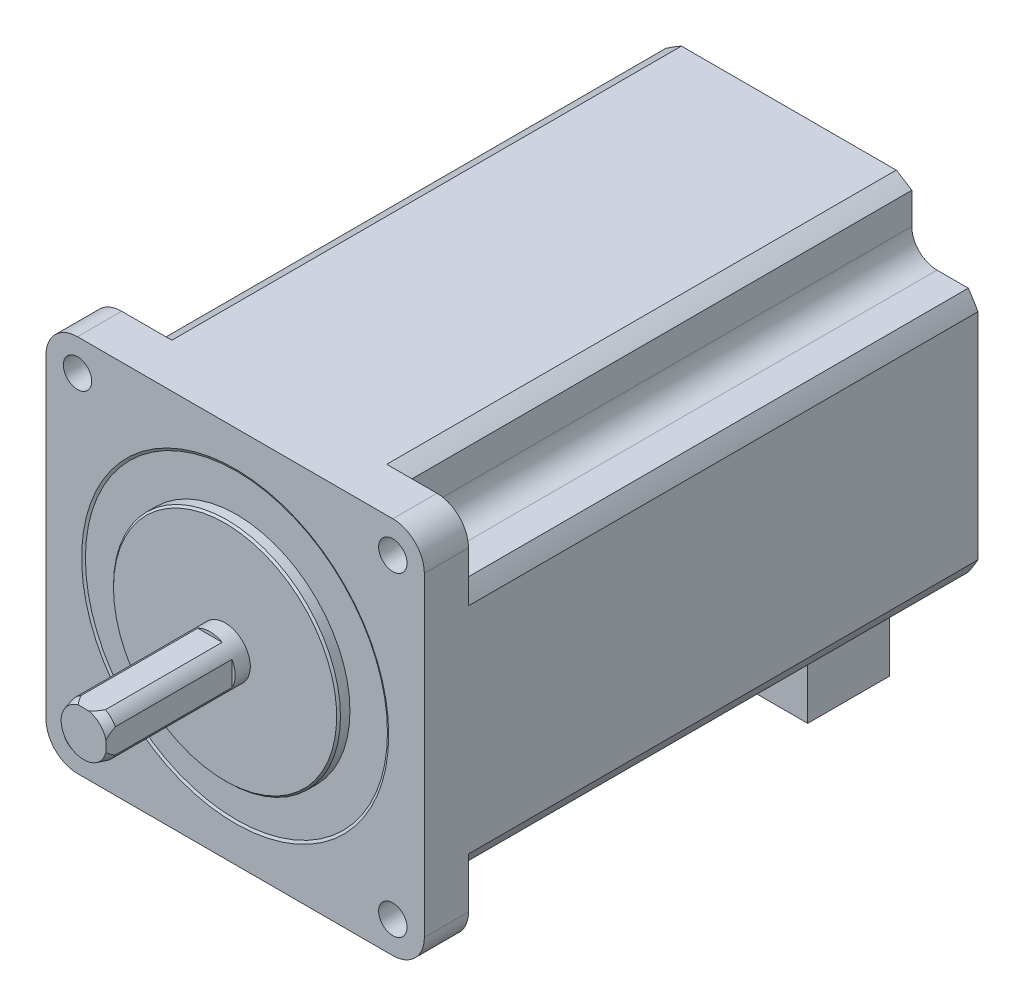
ISO-10303-21;
HEADER;
FILE_DESCRIPTION(('STEP AP214'),'2;1');
FILE_NAME('part.step','',(''),(''),'','','');
FILE_SCHEMA(('AUTOMOTIVE_DESIGN { 1 0 10303 214 1 1 1 1 }'));
ENDSEC;
DATA;
#1=APPLICATION_CONTEXT('core data for automotive mechanical design processes');
#2=APPLICATION_PROTOCOL_DEFINITION('international standard','automotive_design',2000,#1);
#3=PRODUCT_CONTEXT('',#1,'mechanical');
#4=PRODUCT('Part','Part','',(#3));
#5=PRODUCT_RELATED_PRODUCT_CATEGORY('part','',(#4));
#6=PRODUCT_DEFINITION_FORMATION('','',#4);
#7=PRODUCT_DEFINITION_CONTEXT('part definition',#1,'design');
#8=PRODUCT_DEFINITION('design','',#6,#7);
#9=PRODUCT_DEFINITION_SHAPE('','',#8);
#10=(LENGTH_UNIT() NAMED_UNIT(*) SI_UNIT(.MILLI.,.METRE.));
#11=(NAMED_UNIT(*) PLANE_ANGLE_UNIT() SI_UNIT($,.RADIAN.));
#12=(NAMED_UNIT(*) SI_UNIT($,.STERADIAN.) SOLID_ANGLE_UNIT());
#13=UNCERTAINTY_MEASURE_WITH_UNIT(LENGTH_MEASURE(1.E-05),#10,'distance_accuracy_value','');
#14=(GEOMETRIC_REPRESENTATION_CONTEXT(3) GLOBAL_UNCERTAINTY_ASSIGNED_CONTEXT((#13)) GLOBAL_UNIT_ASSIGNED_CONTEXT((#10,
#11,#12)) REPRESENTATION_CONTEXT('',''));
#15=CARTESIAN_POINT('',(0.,0.,0.));
#16=DIRECTION('',(0.,0.,1.));
#17=DIRECTION('',(1.,0.,0.));
#18=AXIS2_PLACEMENT_3D('',#15,#16,#17);
#19=CARTESIAN_POINT('',(0.,0.,22.4));
#20=DIRECTION('',(0.,0.,-1.));
#21=DIRECTION('',(-1.,0.,0.));
#22=AXIS2_PLACEMENT_3D('',#19,#20,#21);
#23=CONICAL_SURFACE('',#22,3.59807621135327,0.261799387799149);
#24=CARTESIAN_POINT('',(3.5,3.65885881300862,16.9316215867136));
#25=CARTESIAN_POINT('',(3.5,3.6023956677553,17.0838864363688));
#26=CARTESIAN_POINT('',(3.5,3.54539058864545,17.2359490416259));
#27=CARTESIAN_POINT('',(3.5,3.4301217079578,17.5396047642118));
#28=CARTESIAN_POINT('',(3.5,3.37185784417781,17.6911978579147));
#29=CARTESIAN_POINT('',(3.5,3.19466893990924,18.1458077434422));
#30=CARTESIAN_POINT('',(3.5,3.07358949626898,18.4479953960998));
#31=CARTESIAN_POINT('',(3.5,2.88202757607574,18.9085831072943));
#32=CARTESIAN_POINT('',(3.5,2.81435636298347,19.0681529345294));
#33=CARTESIAN_POINT('',(3.5,2.67631316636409,19.3861181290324));
#34=CARTESIAN_POINT('',(3.5,2.60594127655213,19.5445135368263));
#35=CARTESIAN_POINT('',(3.5,2.46196785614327,19.8596093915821));
#36=CARTESIAN_POINT('',(3.5,2.38837023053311,20.0163116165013));
#37=CARTESIAN_POINT('',(3.5,2.23702965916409,20.3276939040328));
#38=CARTESIAN_POINT('',(3.5,2.15928717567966,20.4823741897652));
#39=CARTESIAN_POINT('',(3.5,1.99956753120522,20.7867790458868));
#40=CARTESIAN_POINT('',(3.5,1.91766524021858,20.9365427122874));
#41=CARTESIAN_POINT('',(3.5,1.74677024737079,21.2323903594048));
#42=CARTESIAN_POINT('',(3.5,1.65776561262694,21.3784675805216));
#43=CARTESIAN_POINT('',(3.5,1.51770774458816,21.591674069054));
#44=CARTESIAN_POINT('',(3.5,1.47033809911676,21.6612195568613));
#45=CARTESIAN_POINT('',(3.5,1.37275172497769,21.7982748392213));
#46=CARTESIAN_POINT('',(3.5,1.32253564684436,21.8657850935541));
#47=CARTESIAN_POINT('',(3.5,1.21878037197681,21.9979192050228));
#48=CARTESIAN_POINT('',(3.5,1.16525083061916,22.0625505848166));
#49=CARTESIAN_POINT('',(3.5,1.05398107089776,22.1880495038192));
#50=CARTESIAN_POINT('',(3.5,0.996243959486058,22.2489197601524));
#51=CARTESIAN_POINT('',(3.5,0.879074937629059,22.3618808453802));
#52=CARTESIAN_POINT('',(3.5,0.819941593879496,22.4142773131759));
#53=CARTESIAN_POINT('',(3.5,0.69605087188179,22.5121419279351));
#54=CARTESIAN_POINT('',(3.5,0.631293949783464,22.557610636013));
#55=CARTESIAN_POINT('',(3.5,0.507273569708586,22.6311614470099));
#56=CARTESIAN_POINT('',(3.5,0.449006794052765,22.6608914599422));
#57=CARTESIAN_POINT('',(3.5,0.328412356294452,22.710540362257));
#58=CARTESIAN_POINT('',(3.5,0.266093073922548,22.7304788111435));
#59=CARTESIAN_POINT('',(3.5,0.149648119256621,22.7555691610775));
#60=CARTESIAN_POINT('',(3.5,0.0959490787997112,22.7626698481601));
#61=CARTESIAN_POINT('',(3.5,-0.0118697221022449,22.767496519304));
#62=CARTESIAN_POINT('',(3.5,-0.0659893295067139,22.7652257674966));
#63=CARTESIAN_POINT('',(3.5,-0.172879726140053,22.7516191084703));
#64=CARTESIAN_POINT('',(3.5,-0.225653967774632,22.7403094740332));
#65=CARTESIAN_POINT('',(3.5,-0.328872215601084,22.7098978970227));
#66=CARTESIAN_POINT('',(3.5,-0.37931467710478,22.6907908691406));
#67=CARTESIAN_POINT('',(3.5,-0.508714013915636,22.6321380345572));
#68=CARTESIAN_POINT('',(3.5,-0.585263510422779,22.5873371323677));
#69=CARTESIAN_POINT('',(3.5,-0.730938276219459,22.4869137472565));
#70=CARTESIAN_POINT('',(3.5,-0.800033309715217,22.4312495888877));
#71=CARTESIAN_POINT('',(3.5,-0.955746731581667,22.2916879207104));
#72=CARTESIAN_POINT('',(3.5,-1.0396891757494,22.204851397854));
#73=CARTESIAN_POINT('',(3.5,-1.19908801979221,22.0236161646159));
#74=CARTESIAN_POINT('',(3.5,-1.27452504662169,21.9292009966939));
#75=CARTESIAN_POINT('',(3.5,-1.41979524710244,21.7344953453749));
#76=CARTESIAN_POINT('',(3.5,-1.48955344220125,21.6341495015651));
#77=CARTESIAN_POINT('',(3.5,-1.62395149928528,21.4302869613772));
#78=CARTESIAN_POINT('',(3.5,-1.68859694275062,21.326773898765));
#79=CARTESIAN_POINT('',(3.5,-1.85613404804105,21.0470251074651));
#80=CARTESIAN_POINT('',(3.5,-1.95551266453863,20.8686941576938));
#81=CARTESIAN_POINT('',(3.5,-2.14665533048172,20.5079710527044));
#82=CARTESIAN_POINT('',(3.5,-2.23841606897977,20.3255771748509));
#83=CARTESIAN_POINT('',(3.5,-2.41645935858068,19.9576498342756));
#84=CARTESIAN_POINT('',(3.5,-2.50272932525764,19.7721103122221));
#85=CARTESIAN_POINT('',(3.5,-2.67090131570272,19.3990599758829));
#86=CARTESIAN_POINT('',(3.5,-2.75280305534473,19.2115490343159));
#87=CARTESIAN_POINT('',(3.5,-2.90658898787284,18.8504519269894));
#88=CARTESIAN_POINT('',(3.5,-2.97874468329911,18.6769809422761));
#89=CARTESIAN_POINT('',(3.5,-3.12065566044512,18.3290502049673));
#90=CARTESIAN_POINT('',(3.5,-3.19041080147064,18.1545903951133));
#91=CARTESIAN_POINT('',(3.5,-3.32757858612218,17.805733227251));
#92=CARTESIAN_POINT('',(3.5,-3.39500096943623,17.6313396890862));
#93=CARTESIAN_POINT('',(3.5,-3.52813716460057,17.2819241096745));
#94=CARTESIAN_POINT('',(3.5,-3.59385117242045,17.1069021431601));
#95=CARTESIAN_POINT('',(3.5,-3.65885881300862,16.9316215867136));
#96=B_SPLINE_CURVE_WITH_KNOTS('',3,(#24,#25,#26,#27,#28,#29,#30,#31,#32,#33,#34,#35,#36,#37,#38,
#39,#40,#41,#42,#43,#44,#45,#46,#47,#48,#49,#50,#51,#52,#53,#54,#55,#56,#57,#58,#59,#60,#61,#62,
#63,#64,#65,#66,#67,#68,#69,#70,#71,#72,#73,#74,#75,#76,#77,#78,#79,#80,#81,#82,#83,#84,#85,#86,
#87,#88,#89,#90,#91,#92,#93,#94,#95),.UNSPECIFIED.,.F.,.F.,(4,2,2,2,2,2,2,2,2,2,2,2,2,2,2,2,2,2,
2,2,2,2,2,2,2,2,2,2,2,2,2,2,2,2,2,4),(0.,0.487185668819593,0.974395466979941,1.95092394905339,
2.47088362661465,2.99082527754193,3.51015400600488,4.02942493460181,4.54139798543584,
5.0542501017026,5.30663191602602,5.55895628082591,5.81057715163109,6.06201406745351,
6.29868754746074,6.5353418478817,6.73093008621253,6.92612601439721,7.08786234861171,
7.2495423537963,7.41075411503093,7.57207118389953,7.83661046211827,8.10218530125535,
8.46361083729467,8.82584364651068,9.19226963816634,9.55828992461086,10.1704387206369,
10.7828521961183,11.3966221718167,12.0104320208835,12.574048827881,13.1376986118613,
13.6986081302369,14.259453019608),.UNSPECIFIED.);
#97=CARTESIAN_POINT('',(3.5,1.93649167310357,20.9000000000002));
#98=VERTEX_POINT('',#97);
#99=CARTESIAN_POINT('',(3.5,0.834357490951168,22.4));
#100=VERTEX_POINT('',#99);
#101=EDGE_CURVE('E307',#98,#100,#96,.T.);
#102=ORIENTED_EDGE('',*,*,#101,.F.);
#103=CARTESIAN_POINT('',(0.,0.,20.8999999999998));
#104=DIRECTION('',(0.,0.,1.));
#105=DIRECTION('',(1.,0.,0.));
#106=AXIS2_PLACEMENT_3D('',#103,#104,#105);
#107=CIRCLE('',#106,4.);
#108=CARTESIAN_POINT('',(1.93649167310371,3.5,20.8999999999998));
#109=VERTEX_POINT('',#108);
#110=EDGE_CURVE('E334',#109,#98,#107,.F.);
#111=ORIENTED_EDGE('',*,*,#110,.F.);
#112=CARTESIAN_POINT('',(-3.86930929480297,3.5,16.3564970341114));
#113=CARTESIAN_POINT('',(-3.81130684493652,3.5,16.5170199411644));
#114=CARTESIAN_POINT('',(-3.75279353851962,3.5,16.6773588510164));
#115=CARTESIAN_POINT('',(-3.63458077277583,3.5,16.9976052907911));
#116=CARTESIAN_POINT('',(-3.57488126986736,3.5,17.1575128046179));
#117=CARTESIAN_POINT('',(-3.39361030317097,3.5,17.6368798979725));
#118=CARTESIAN_POINT('',(-3.27001249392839,3.5,17.9555770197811));
#119=CARTESIAN_POINT('',(-3.01244232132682,3.5,18.5978750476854));
#120=CARTESIAN_POINT('',(-2.87828989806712,3.5,18.9214046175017));
#121=CARTESIAN_POINT('',(-2.66885480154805,3.5,19.4030223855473));
#122=CARTESIAN_POINT('',(-2.5976976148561,3.5,19.5629021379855));
#123=CARTESIAN_POINT('',(-2.4519712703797,3.5,19.8810939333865));
#124=CARTESIAN_POINT('',(-2.37740232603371,3.5,20.039406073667));
#125=CARTESIAN_POINT('',(-2.22441816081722,3.5,20.3530265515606));
#126=CARTESIAN_POINT('',(-2.14602805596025,3.5,20.5083470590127));
#127=CARTESIAN_POINT('',(-1.98368792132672,3.5,20.8162072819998));
#128=CARTESIAN_POINT('',(-1.89973412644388,3.5,20.9687450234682));
#129=CARTESIAN_POINT('',(-1.72475802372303,3.5,21.269028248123));
#130=CARTESIAN_POINT('',(-1.6337634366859,3.5,21.4167895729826));
#131=CARTESIAN_POINT('',(-1.48957033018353,3.5,21.6332031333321));
#132=CARTESIAN_POINT('',(-1.44025385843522,3.5,21.7044290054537));
#133=CARTESIAN_POINT('',(-1.33846826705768,3.5,21.8445807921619));
#134=CARTESIAN_POINT('',(-1.28599919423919,3.5,21.9135067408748));
#135=CARTESIAN_POINT('',(-1.15028154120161,3.5,22.0816859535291));
#136=CARTESIAN_POINT('',(-1.06463830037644,3.5,22.179089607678));
#137=CARTESIAN_POINT('',(-0.927427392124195,3.5,22.3162128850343));
#138=CARTESIAN_POINT('',(-0.880306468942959,3.5,22.3603667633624));
#139=CARTESIAN_POINT('',(-0.782611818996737,3.5,22.4446415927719));
#140=CARTESIAN_POINT('',(-0.732041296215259,3.5,22.4847662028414));
#141=CARTESIAN_POINT('',(-0.626326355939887,3.5,22.5599557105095));
#142=CARTESIAN_POINT('',(-0.57113622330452,3.5,22.5949574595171));
#143=CARTESIAN_POINT('',(-0.456439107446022,3.5,22.6571140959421));
#144=CARTESIAN_POINT('',(-0.396936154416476,3.5,22.6842761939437));
#145=CARTESIAN_POINT('',(-0.282931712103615,3.5,22.7248685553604));
#146=CARTESIAN_POINT('',(-0.228944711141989,3.5,22.739713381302));
#147=CARTESIAN_POINT('',(-0.119250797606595,3.5,22.7600378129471));
#148=CARTESIAN_POINT('',(-0.0635463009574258,3.5,22.7655300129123));
#149=CARTESIAN_POINT('',(0.0480719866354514,3.5,22.7664569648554));
#150=CARTESIAN_POINT('',(0.103985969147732,3.5,22.7618697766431));
#151=CARTESIAN_POINT('',(0.214216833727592,3.5,22.7432034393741));
#152=CARTESIAN_POINT('',(0.268531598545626,3.5,22.7291122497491));
#153=CARTESIAN_POINT('',(0.392914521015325,3.5,22.6866590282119));
#154=CARTESIAN_POINT('',(0.46184869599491,3.5,22.655029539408));
#155=CARTESIAN_POINT('',(0.593979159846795,3.5,22.5815220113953));
#156=CARTESIAN_POINT('',(0.657160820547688,3.5,22.5396187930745));
#157=CARTESIAN_POINT('',(0.775505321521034,3.5,22.4508929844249));
#158=CARTESIAN_POINT('',(0.830900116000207,3.5,22.4043731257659));
#159=CARTESIAN_POINT('',(0.937609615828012,3.5,22.3068263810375));
#160=CARTESIAN_POINT('',(0.988920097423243,3.5,22.2557949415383));
#161=CARTESIAN_POINT('',(1.08824660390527,3.5,22.1503476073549));
#162=CARTESIAN_POINT('',(1.13625167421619,3.5,22.095921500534));
#163=CARTESIAN_POINT('',(1.22933749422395,3.5,21.9846920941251));
#164=CARTESIAN_POINT('',(1.27441975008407,3.5,21.9278900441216));
#165=CARTESIAN_POINT('',(1.40470096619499,3.5,21.7565363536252));
#166=CARTESIAN_POINT('',(1.48644178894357,3.5,21.639361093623));
#167=CARTESIAN_POINT('',(1.64319201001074,3.5,21.4005598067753));
#168=CARTESIAN_POINT('',(1.71819627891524,3.5,21.2789304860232));
#169=CARTESIAN_POINT('',(1.86323185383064,3.5,21.0323940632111));
#170=CARTESIAN_POINT('',(1.93325170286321,3.5,20.9074802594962));
#171=CARTESIAN_POINT('',(2.06928175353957,3.5,20.6554785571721));
#172=CARTESIAN_POINT('',(2.13529130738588,3.5,20.5283903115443));
#173=CARTESIAN_POINT('',(2.26442116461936,3.5,20.2719514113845));
#174=CARTESIAN_POINT('',(2.32752509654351,3.5,20.1425925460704));
#175=CARTESIAN_POINT('',(2.45107743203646,3.5,19.8826099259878));
#176=CARTESIAN_POINT('',(2.51152569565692,3.5,19.7519861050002));
#177=CARTESIAN_POINT('',(2.68941804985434,3.5,19.358992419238));
#178=CARTESIAN_POINT('',(2.80358743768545,3.5,19.0951401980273));
#179=CARTESIAN_POINT('',(3.00048591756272,3.5,18.6248626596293));
#180=CARTESIAN_POINT('',(3.0844809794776,3.5,18.4189605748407));
#181=CARTESIAN_POINT('',(3.24945704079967,3.5,18.0058641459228));
#182=CARTESIAN_POINT('',(3.33043691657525,3.5,17.7986693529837));
#183=CARTESIAN_POINT('',(3.48887984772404,3.5,17.3860176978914));
#184=CARTESIAN_POINT('',(3.56637485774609,3.5,17.1805730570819));
#185=CARTESIAN_POINT('',(3.71929183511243,3.5,16.7690161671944));
#186=CARTESIAN_POINT('',(3.79471470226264,3.5,16.5629042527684));
#187=CARTESIAN_POINT('',(3.86930929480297,3.5,16.3564970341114));
#188=B_SPLINE_CURVE_WITH_KNOTS('',3,(#112,#113,#114,#115,#116,#117,#118,#119,#120,#121,#122,
#123,#124,#125,#126,#127,#128,#129,#130,#131,#132,#133,#134,#135,#136,#137,#138,#139,#140,#141,
#142,#143,#144,#145,#146,#147,#148,#149,#150,#151,#152,#153,#154,#155,#156,#157,#158,#159,#160,
#161,#162,#163,#164,#165,#166,#167,#168,#169,#170,#171,#172,#173,#174,#175,#176,#177,#178,#179,
#180,#181,#182,#183,#184,#185,#186,#187),.UNSPECIFIED.,.F.,.F.,(4,2,2,2,2,2,2,2,2,2,2,2,2,2,2,2,
2,2,2,2,2,2,2,2,2,2,2,2,2,2,2,2,2,2,2,2,2,4),(0.,0.512041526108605,1.02410189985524,
2.04951981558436,3.10007779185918,3.62504636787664,4.1499821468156,4.67184000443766,
5.1940546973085,5.71430882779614,5.97412878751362,6.23394489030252,6.62218502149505,
6.8157513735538,7.00914032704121,7.20474211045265,7.40016340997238,7.56743042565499,
7.73447202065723,7.90187758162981,8.06949562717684,8.29573563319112,8.52253575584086,
8.73922123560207,8.95612796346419,9.17372201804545,9.39120303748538,9.81942658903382,
10.2479734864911,10.6774755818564,11.1070468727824,11.5387992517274,11.9705743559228,
12.8329204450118,13.5000255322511,14.1673767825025,14.8260894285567,15.4845113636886),.UNSPECIFIED.);
#189=CARTESIAN_POINT('',(0.834357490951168,3.5,22.4));
#190=VERTEX_POINT('',#189);
#191=EDGE_CURVE('E326',#190,#109,#188,.T.);
#192=ORIENTED_EDGE('',*,*,#191,.F.);
#193=CARTESIAN_POINT('',(0.,0.,22.4));
#194=DIRECTION('',(0.,0.,1.));
#195=DIRECTION('',(1.,0.,0.));
#196=AXIS2_PLACEMENT_3D('',#193,#194,#195);
#197=CIRCLE('',#196,3.59807621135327);
#198=EDGE_CURVE('E61',#100,#190,#197,.T.);
#199=ORIENTED_EDGE('',*,*,#198,.F.);
#200=EDGE_LOOP('',(#102,#111,#192,#199));
#201=FACE_BOUND('',#200,.T.);
#202=ADVANCED_FACE('F39',(#201),#23,.T.);
#203=CARTESIAN_POINT('',(0.,0.,22.4));
#204=DIRECTION('',(0.,0.,-1.));
#205=DIRECTION('',(-1.,0.,0.));
#206=AXIS2_PLACEMENT_3D('',#203,#204,#205);
#207=CYLINDRICAL_SURFACE('',#206,4.);
#208=ORIENTED_EDGE('',*,*,#110,.T.);
#209=DIRECTION('',(0.,0.,-1.));
#210=VECTOR('',#209,1.);
#211=CARTESIAN_POINT('',(3.5,1.93649167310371,22.4));
#212=LINE('',#211,#210);
#213=CARTESIAN_POINT('',(3.5,1.93649167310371,2.4));
#214=VERTEX_POINT('',#213);
#215=EDGE_CURVE('E311',#98,#214,#212,.T.);
#216=ORIENTED_EDGE('',*,*,#215,.T.);
#217=CARTESIAN_POINT('',(0.,0.,2.4));
#218=DIRECTION('',(0.,0.,-1.));
#219=DIRECTION('',(-1.,0.,0.));
#220=AXIS2_PLACEMENT_3D('',#217,#218,#219);
#221=CIRCLE('',#220,4.);
#222=CARTESIAN_POINT('',(3.5,-1.93649167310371,2.4));
#223=VERTEX_POINT('',#222);
#224=EDGE_CURVE('E315',#214,#223,#221,.T.);
#225=ORIENTED_EDGE('',*,*,#224,.T.);
#226=DIRECTION('',(0.,0.,-1.));
#227=VECTOR('',#226,1.);
#228=CARTESIAN_POINT('',(3.5,-1.93649167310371,22.4));
#229=LINE('',#228,#227);
#230=CARTESIAN_POINT('',(3.5,-1.93649167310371,20.8999999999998));
#231=VERTEX_POINT('',#230);
#232=EDGE_CURVE('E549',#223,#231,#229,.F.);
#233=ORIENTED_EDGE('',*,*,#232,.T.);
#234=CARTESIAN_POINT('',(-1.93649167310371,3.5,20.8999999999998));
#235=VERTEX_POINT('',#234);
#236=EDGE_CURVE('E329',#231,#235,#107,.F.);
#237=ORIENTED_EDGE('',*,*,#236,.T.);
#238=DIRECTION('',(0.,0.,-1.));
#239=VECTOR('',#238,1.);
#240=CARTESIAN_POINT('',(-1.93649167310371,3.5,22.4));
#241=LINE('',#240,#239);
#242=CARTESIAN_POINT('',(-1.93649167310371,3.5,2.4));
#243=VERTEX_POINT('',#242);
#244=EDGE_CURVE('E561',#235,#243,#241,.T.);
#245=ORIENTED_EDGE('',*,*,#244,.T.);
#246=CARTESIAN_POINT('',(0.,0.,2.4));
#247=DIRECTION('',(0.,0.,1.));
#248=DIRECTION('',(1.,0.,0.));
#249=AXIS2_PLACEMENT_3D('',#246,#247,#248);
#250=CIRCLE('',#249,4.);
#251=CARTESIAN_POINT('',(1.93649167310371,3.5,2.4));
#252=VERTEX_POINT('',#251);
#253=EDGE_CURVE('E343',#252,#243,#250,.T.);
#254=ORIENTED_EDGE('',*,*,#253,.F.);
#255=DIRECTION('',(0.,0.,-1.));
#256=VECTOR('',#255,1.);
#257=CARTESIAN_POINT('',(1.93649167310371,3.5,22.4));
#258=LINE('',#257,#256);
#259=EDGE_CURVE('E557',#252,#109,#258,.F.);
#260=ORIENTED_EDGE('',*,*,#259,.T.);
#261=EDGE_LOOP('',(#208,#216,#225,#233,#237,#245,#254,#260));
#262=FACE_BOUND('',#261,.T.);
#263=CARTESIAN_POINT('',(0.,0.,0.));
#264=DIRECTION('',(0.,0.,-1.));
#265=DIRECTION('',(-1.,0.,0.));
#266=AXIS2_PLACEMENT_3D('',#263,#264,#265);
#267=CIRCLE('',#266,4.);
#268=CARTESIAN_POINT('',(-4.,0.,0.));
#269=VERTEX_POINT('',#268);
#270=EDGE_CURVE('E787',#269,#269,#267,.T.);
#271=ORIENTED_EDGE('',*,*,#270,.F.);
#272=EDGE_LOOP('',(#271));
#273=FACE_BOUND('',#272,.T.);
#274=ADVANCED_FACE('F479',(#262,#273),#207,.T.);
#275=CARTESIAN_POINT('',(0.,0.,22.4));
#276=DIRECTION('',(0.,0.,1.));
#277=DIRECTION('',(1.,0.,0.));
#278=AXIS2_PLACEMENT_3D('',#275,#276,#277);
#279=PLANE('',#278);
#280=DIRECTION('',(0.,-1.,0.));
#281=VECTOR('',#280,1.);
#282=CARTESIAN_POINT('',(3.5,2.44128177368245,22.4));
#283=LINE('',#282,#281);
#284=CARTESIAN_POINT('',(3.5,-0.834357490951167,22.4));
#285=VERTEX_POINT('',#284);
#286=EDGE_CURVE('E54',#100,#285,#283,.T.);
#287=ORIENTED_EDGE('',*,*,#286,.F.);
#288=ORIENTED_EDGE('',*,*,#198,.T.);
#289=DIRECTION('',(1.,0.,0.));
#290=VECTOR('',#289,1.);
#291=CARTESIAN_POINT('',(-4.72781232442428,3.5,22.4));
#292=LINE('',#291,#290);
#293=CARTESIAN_POINT('',(-0.834357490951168,3.5,22.4));
#294=VERTEX_POINT('',#293);
#295=EDGE_CURVE('E553',#294,#190,#292,.T.);
#296=ORIENTED_EDGE('',*,*,#295,.F.);
#297=EDGE_CURVE('E321',#294,#285,#197,.T.);
#298=ORIENTED_EDGE('',*,*,#297,.T.);
#299=EDGE_LOOP('',(#287,#288,#296,#298));
#300=FACE_BOUND('',#299,.T.);
#301=ADVANCED_FACE('F319',(#300),#279,.T.);
#302=CARTESIAN_POINT('',(0.,0.,0.));
#303=DIRECTION('',(0.,0.,-1.));
#304=DIRECTION('',(-1.,0.,0.));
#305=AXIS2_PLACEMENT_3D('',#302,#303,#304);
#306=PLANE('',#305);
#307=CARTESIAN_POINT('',(0.,0.,0.));
#308=DIRECTION('',(0.,0.,-1.));
#309=DIRECTION('',(-1.,0.,0.));
#310=AXIS2_PLACEMENT_3D('',#307,#308,#309);
#311=CIRCLE('',#310,17.7);
#312=CARTESIAN_POINT('',(-17.7,0.,0.));
#313=VERTEX_POINT('',#312);
#314=EDGE_CURVE('E47',#313,#313,#311,.F.);
#315=ORIENTED_EDGE('',*,*,#314,.T.);
#316=EDGE_LOOP('',(#315));
#317=FACE_BOUND('',#316,.T.);
#318=ORIENTED_EDGE('',*,*,#270,.T.);
#319=EDGE_LOOP('',(#318));
#320=FACE_BOUND('',#319,.T.);
#321=ADVANCED_FACE('F469',(#317,#320),#306,.F.);
#322=CARTESIAN_POINT('',(0.,0.,-1.6));
#323=DIRECTION('',(0.,0.,1.));
#324=DIRECTION('',(1.,0.,0.));
#325=AXIS2_PLACEMENT_3D('',#322,#323,#324);
#326=CYLINDRICAL_SURFACE('',#325,18.);
#327=CARTESIAN_POINT('',(0.,0.,-0.300000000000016));
#328=DIRECTION('',(0.,0.,-1.));
#329=DIRECTION('',(-1.,0.,0.));
#330=AXIS2_PLACEMENT_3D('',#327,#328,#329);
#331=CIRCLE('',#330,18.);
#332=CARTESIAN_POINT('',(-18.,0.,-0.300000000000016));
#333=VERTEX_POINT('',#332);
#334=EDGE_CURVE('E1386',#333,#333,#331,.T.);
#335=ORIENTED_EDGE('',*,*,#334,.T.);
#336=EDGE_LOOP('',(#335));
#337=FACE_BOUND('',#336,.T.);
#338=CARTESIAN_POINT('',(0.,0.,-1.8));
#339=DIRECTION('',(0.,0.,1.));
#340=DIRECTION('',(1.,0.,0.));
#341=AXIS2_PLACEMENT_3D('',#338,#339,#340);
#342=CIRCLE('',#341,18.);
#343=CARTESIAN_POINT('',(18.,0.,-1.8));
#344=VERTEX_POINT('',#343);
#345=EDGE_CURVE('E542',#344,#344,#342,.T.);
#346=ORIENTED_EDGE('',*,*,#345,.T.);
#347=EDGE_LOOP('',(#346));
#348=FACE_BOUND('',#347,.T.);
#349=ADVANCED_FACE('F472',(#337,#348),#326,.T.);
#350=EDGE_CURVE('E316',#285,#231,#96,.T.);
#351=ORIENTED_EDGE('',*,*,#350,.F.);
#352=ORIENTED_EDGE('',*,*,#297,.F.);
#353=EDGE_CURVE('E342',#235,#294,#188,.T.);
#354=ORIENTED_EDGE('',*,*,#353,.F.);
#355=ORIENTED_EDGE('',*,*,#236,.F.);
#356=EDGE_LOOP('',(#351,#352,#354,#355));
#357=FACE_BOUND('',#356,.T.);
#358=ADVANCED_FACE('F344',(#357),#23,.T.);
#359=CARTESIAN_POINT('',(0.,0.,2.4));
#360=DIRECTION('',(0.,0.,1.));
#361=DIRECTION('',(1.,0.,0.));
#362=AXIS2_PLACEMENT_3D('',#359,#360,#361);
#363=PLANE('',#362);
#364=ORIENTED_EDGE('',*,*,#253,.T.);
#365=DIRECTION('',(1.,0.,0.));
#366=VECTOR('',#365,1.);
#367=CARTESIAN_POINT('',(-4.72781232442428,3.5,2.4));
#368=LINE('',#367,#366);
#369=EDGE_CURVE('E554',#243,#252,#368,.T.);
#370=ORIENTED_EDGE('',*,*,#369,.T.);
#371=EDGE_LOOP('',(#364,#370));
#372=FACE_BOUND('',#371,.T.);
#373=ADVANCED_FACE('F353',(#372),#363,.T.);
#374=CARTESIAN_POINT('',(-4.72781232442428,3.5,2.4));
#375=DIRECTION('',(0.,-1.,0.));
#376=DIRECTION('',(0.,0.,-1.));
#377=AXIS2_PLACEMENT_3D('',#374,#375,#376);
#378=PLANE('',#377);
#379=ORIENTED_EDGE('',*,*,#353,.T.);
#380=ORIENTED_EDGE('',*,*,#295,.T.);
#381=ORIENTED_EDGE('',*,*,#191,.T.);
#382=ORIENTED_EDGE('',*,*,#259,.F.);
#383=ORIENTED_EDGE('',*,*,#369,.F.);
#384=ORIENTED_EDGE('',*,*,#244,.F.);
#385=EDGE_LOOP('',(#379,#380,#381,#382,#383,#384));
#386=FACE_BOUND('',#385,.T.);
#387=ADVANCED_FACE('F347',(#386),#378,.F.);
#388=CARTESIAN_POINT('',(0.,0.,2.4));
#389=DIRECTION('',(0.,0.,-1.));
#390=DIRECTION('',(-1.,0.,0.));
#391=AXIS2_PLACEMENT_3D('',#388,#389,#390);
#392=PLANE('',#391);
#393=DIRECTION('',(0.,-1.,0.));
#394=VECTOR('',#393,1.);
#395=CARTESIAN_POINT('',(3.5,2.44128177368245,2.4));
#396=LINE('',#395,#394);
#397=EDGE_CURVE('E322',#214,#223,#396,.T.);
#398=ORIENTED_EDGE('',*,*,#397,.T.);
#399=ORIENTED_EDGE('',*,*,#224,.F.);
#400=EDGE_LOOP('',(#398,#399));
#401=FACE_BOUND('',#400,.T.);
#402=ADVANCED_FACE('F352',(#401),#392,.F.);
#403=CARTESIAN_POINT('',(3.5,2.44128177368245,2.4));
#404=DIRECTION('',(-1.,0.,0.));
#405=DIRECTION('',(0.,-1.,0.));
#406=AXIS2_PLACEMENT_3D('',#403,#404,#405);
#407=PLANE('',#406);
#408=ORIENTED_EDGE('',*,*,#101,.T.);
#409=ORIENTED_EDGE('',*,*,#286,.T.);
#410=ORIENTED_EDGE('',*,*,#350,.T.);
#411=ORIENTED_EDGE('',*,*,#232,.F.);
#412=ORIENTED_EDGE('',*,*,#397,.F.);
#413=ORIENTED_EDGE('',*,*,#215,.F.);
#414=EDGE_LOOP('',(#408,#409,#410,#411,#412,#413));
#415=FACE_BOUND('',#414,.T.);
#416=ADVANCED_FACE('F308',(#415),#407,.F.);
#417=CARTESIAN_POINT('',(0.,0.,-0.300000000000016));
#418=DIRECTION('',(0.,0.,-1.));
#419=DIRECTION('',(-1.,0.,0.));
#420=AXIS2_PLACEMENT_3D('',#417,#418,#419);
#421=CONICAL_SURFACE('',#420,18.,0.785398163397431);
#422=ORIENTED_EDGE('',*,*,#314,.F.);
#423=EDGE_LOOP('',(#422));
#424=FACE_BOUND('',#423,.T.);
#425=ORIENTED_EDGE('',*,*,#334,.F.);
#426=EDGE_LOOP('',(#425));
#427=FACE_BOUND('',#426,.T.);
#428=ADVANCED_FACE('F528',(#424,#427),#421,.T.);
#429=CARTESIAN_POINT('',(0.,0.,-1.8));
#430=DIRECTION('',(0.,0.,1.));
#431=DIRECTION('',(1.,0.,0.));
#432=AXIS2_PLACEMENT_3D('',#429,#430,#431);
#433=PLANE('',#432);
#434=CARTESIAN_POINT('',(0.,0.,-1.8));
#435=DIRECTION('',(0.,0.,1.));
#436=DIRECTION('',(1.,0.,0.));
#437=AXIS2_PLACEMENT_3D('',#434,#435,#436);
#438=CIRCLE('',#437,23.95);
#439=CARTESIAN_POINT('',(23.95,0.,-1.8));
#440=VERTEX_POINT('',#439);
#441=EDGE_CURVE('E11',#440,#440,#438,.T.);
#442=ORIENTED_EDGE('',*,*,#441,.T.);
#443=EDGE_LOOP('',(#442));
#444=FACE_BOUND('',#443,.T.);
#445=ORIENTED_EDGE('',*,*,#345,.F.);
#446=EDGE_LOOP('',(#445));
#447=FACE_BOUND('',#446,.T.);
#448=ADVANCED_FACE('F391',(#444,#447),#433,.T.);
#449=CARTESIAN_POINT('',(0.,-19.4999999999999,-89.4));
#450=DIRECTION('',(0.,1.,0.));
#451=DIRECTION('',(-1.,0.,0.));
#452=AXIS2_PLACEMENT_3D('',#449,#450,#451);
#453=PLANE('',#452);
#454=DIRECTION('',(-1.,0.,0.));
#455=VECTOR('',#454,1.);
#456=CARTESIAN_POINT('',(0.,-19.4999999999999,-89.4));
#457=LINE('',#456,#455);
#458=CARTESIAN_POINT('',(-23.5,-19.5,-89.4));
#459=VERTEX_POINT('',#458);
#460=CARTESIAN_POINT('',(-28.4604989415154,-19.5,-89.4));
#461=VERTEX_POINT('',#460);
#462=EDGE_CURVE('E631',#459,#461,#457,.T.);
#463=ORIENTED_EDGE('',*,*,#462,.F.);
#464=DIRECTION('',(0.,0.,1.));
#465=VECTOR('',#464,1.);
#466=CARTESIAN_POINT('',(-23.5,-19.5,-89.4));
#467=LINE('',#466,#465);
#468=CARTESIAN_POINT('',(-23.5,-19.5,-8.6));
#469=VERTEX_POINT('',#468);
#470=EDGE_CURVE('E697',#459,#469,#467,.T.);
#471=ORIENTED_EDGE('',*,*,#470,.T.);
#472=DIRECTION('',(-1.,0.,0.));
#473=VECTOR('',#472,1.);
#474=CARTESIAN_POINT('',(0.,-19.4999999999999,-8.6));
#475=LINE('',#474,#473);
#476=CARTESIAN_POINT('',(-28.4604989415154,-19.5,-8.6));
#477=VERTEX_POINT('',#476);
#478=EDGE_CURVE('E871',#469,#477,#475,.T.);
#479=ORIENTED_EDGE('',*,*,#478,.T.);
#480=DIRECTION('',(0.,0.,1.));
#481=VECTOR('',#480,1.);
#482=CARTESIAN_POINT('',(-28.4604989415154,-19.5,-89.4));
#483=LINE('',#482,#481);
#484=EDGE_CURVE('E873',#461,#477,#483,.T.);
#485=ORIENTED_EDGE('',*,*,#484,.F.);
#486=EDGE_LOOP('',(#463,#471,#479,#485));
#487=FACE_BOUND('',#486,.T.);
#488=ADVANCED_FACE('F387',(#487),#453,.F.);
#489=CARTESIAN_POINT('',(-23.5,-23.5,-89.4));
#490=DIRECTION('',(0.,0.,1.));
#491=DIRECTION('',(1.,0.,0.));
#492=AXIS2_PLACEMENT_3D('',#489,#490,#491);
#493=CYLINDRICAL_SURFACE('',#492,4.);
#494=CARTESIAN_POINT('',(-23.5,-23.5,-89.4));
#495=DIRECTION('',(0.,0.,-1.));
#496=DIRECTION('',(-1.,0.,0.));
#497=AXIS2_PLACEMENT_3D('',#494,#495,#496);
#498=CIRCLE('',#497,4.);
#499=CARTESIAN_POINT('',(-19.5,-23.5,-89.4));
#500=VERTEX_POINT('',#499);
#501=EDGE_CURVE('E720',#500,#459,#498,.F.);
#502=ORIENTED_EDGE('',*,*,#501,.F.);
#503=DIRECTION('',(0.,0.,1.));
#504=VECTOR('',#503,1.);
#505=CARTESIAN_POINT('',(-19.5,-23.5,-89.4));
#506=LINE('',#505,#504);
#507=CARTESIAN_POINT('',(-19.5,-23.5,-8.6));
#508=VERTEX_POINT('',#507);
#509=EDGE_CURVE('E702',#508,#500,#506,.F.);
#510=ORIENTED_EDGE('',*,*,#509,.F.);
#511=CARTESIAN_POINT('',(-23.5,-23.5,-8.6));
#512=DIRECTION('',(0.,0.,-1.));
#513=DIRECTION('',(-1.,0.,0.));
#514=AXIS2_PLACEMENT_3D('',#511,#512,#513);
#515=CIRCLE('',#514,4.);
#516=EDGE_CURVE('E700',#469,#508,#515,.T.);
#517=ORIENTED_EDGE('',*,*,#516,.F.);
#518=ORIENTED_EDGE('',*,*,#470,.F.);
#519=EDGE_LOOP('',(#502,#510,#517,#518));
#520=FACE_BOUND('',#519,.T.);
#521=ADVANCED_FACE('F390',(#520),#493,.F.);
#522=CARTESIAN_POINT('',(-19.5,0.,-89.4));
#523=DIRECTION('',(-1.,0.,0.));
#524=DIRECTION('',(0.,-1.,0.));
#525=AXIS2_PLACEMENT_3D('',#522,#523,#524);
#526=PLANE('',#525);
#527=DIRECTION('',(0.,-1.,0.));
#528=VECTOR('',#527,1.);
#529=CARTESIAN_POINT('',(-19.5,0.,-8.6));
#530=LINE('',#529,#528);
#531=CARTESIAN_POINT('',(-19.5,-28.4604989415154,-8.6));
#532=VERTEX_POINT('',#531);
#533=EDGE_CURVE('E869',#508,#532,#530,.T.);
#534=ORIENTED_EDGE('',*,*,#533,.F.);
#535=ORIENTED_EDGE('',*,*,#509,.T.);
#536=DIRECTION('',(0.,-1.,0.));
#537=VECTOR('',#536,1.);
#538=CARTESIAN_POINT('',(-19.5,0.,-89.4));
#539=LINE('',#538,#537);
#540=CARTESIAN_POINT('',(-19.5,-28.4604989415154,-89.4));
#541=VERTEX_POINT('',#540);
#542=EDGE_CURVE('E629',#500,#541,#539,.T.);
#543=ORIENTED_EDGE('',*,*,#542,.T.);
#544=DIRECTION('',(0.,0.,1.));
#545=VECTOR('',#544,1.);
#546=CARTESIAN_POINT('',(-19.5,-28.4604989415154,-89.4));
#547=LINE('',#546,#545);
#548=EDGE_CURVE('E876',#541,#532,#547,.T.);
#549=ORIENTED_EDGE('',*,*,#548,.T.);
#550=EDGE_LOOP('',(#534,#535,#543,#549));
#551=FACE_BOUND('',#550,.T.);
#552=ADVANCED_FACE('F393',(#551),#526,.T.);
#553=CARTESIAN_POINT('',(-19.5,0.,-89.4));
#554=DIRECTION('',(-1.,0.,0.));
#555=DIRECTION('',(0.,-1.,0.));
#556=AXIS2_PLACEMENT_3D('',#553,#554,#555);
#557=PLANE('',#556);
#558=DIRECTION('',(0.,-1.,0.));
#559=VECTOR('',#558,1.);
#560=CARTESIAN_POINT('',(-19.5,0.,-89.4));
#561=LINE('',#560,#559);
#562=CARTESIAN_POINT('',(-19.5,28.4604989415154,-89.4));
#563=VERTEX_POINT('',#562);
#564=CARTESIAN_POINT('',(-19.5,23.5,-89.4));
#565=VERTEX_POINT('',#564);
#566=EDGE_CURVE('E602',#563,#565,#561,.T.);
#567=ORIENTED_EDGE('',*,*,#566,.T.);
#568=DIRECTION('',(0.,0.,1.));
#569=VECTOR('',#568,1.);
#570=CARTESIAN_POINT('',(-19.5,23.5,-8.6));
#571=LINE('',#570,#569);
#572=CARTESIAN_POINT('',(-19.5,23.5,-8.6));
#573=VERTEX_POINT('',#572);
#574=EDGE_CURVE('E704',#565,#573,#571,.T.);
#575=ORIENTED_EDGE('',*,*,#574,.T.);
#576=DIRECTION('',(0.,-1.,0.));
#577=VECTOR('',#576,1.);
#578=CARTESIAN_POINT('',(-19.5,0.,-8.6));
#579=LINE('',#578,#577);
#580=CARTESIAN_POINT('',(-19.5,28.4604989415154,-8.6));
#581=VERTEX_POINT('',#580);
#582=EDGE_CURVE('E683',#581,#573,#579,.T.);
#583=ORIENTED_EDGE('',*,*,#582,.F.);
#584=DIRECTION('',(0.,0.,1.));
#585=VECTOR('',#584,1.);
#586=CARTESIAN_POINT('',(-19.5,28.4604989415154,-89.4));
#587=LINE('',#586,#585);
#588=EDGE_CURVE('E686',#563,#581,#587,.T.);
#589=ORIENTED_EDGE('',*,*,#588,.F.);
#590=EDGE_LOOP('',(#567,#575,#583,#589));
#591=FACE_BOUND('',#590,.T.);
#592=ADVANCED_FACE('F396',(#591),#557,.T.);
#593=CARTESIAN_POINT('',(-23.5,23.5,-89.4));
#594=DIRECTION('',(0.,0.,-1.));
#595=DIRECTION('',(-1.,0.,0.));
#596=AXIS2_PLACEMENT_3D('',#593,#594,#595);
#597=CYLINDRICAL_SURFACE('',#596,4.);
#598=CARTESIAN_POINT('',(-23.5,23.5,-89.4));
#599=DIRECTION('',(0.,0.,-1.));
#600=DIRECTION('',(-1.,0.,0.));
#601=AXIS2_PLACEMENT_3D('',#598,#599,#600);
#602=CIRCLE('',#601,4.);
#603=CARTESIAN_POINT('',(-23.5,19.5,-89.4));
#604=VERTEX_POINT('',#603);
#605=EDGE_CURVE('E330',#604,#565,#602,.F.);
#606=ORIENTED_EDGE('',*,*,#605,.F.);
#607=DIRECTION('',(0.,0.,1.));
#608=VECTOR('',#607,1.);
#609=CARTESIAN_POINT('',(-23.5,19.5,-89.4));
#610=LINE('',#609,#608);
#611=CARTESIAN_POINT('',(-23.5,19.5,-8.6));
#612=VERTEX_POINT('',#611);
#613=EDGE_CURVE('E709',#612,#604,#610,.F.);
#614=ORIENTED_EDGE('',*,*,#613,.F.);
#615=CARTESIAN_POINT('',(-23.5,23.5,-8.6));
#616=DIRECTION('',(0.,0.,-1.));
#617=DIRECTION('',(-1.,0.,0.));
#618=AXIS2_PLACEMENT_3D('',#615,#616,#617);
#619=CIRCLE('',#618,4.);
#620=EDGE_CURVE('E707',#573,#612,#619,.T.);
#621=ORIENTED_EDGE('',*,*,#620,.F.);
#622=ORIENTED_EDGE('',*,*,#574,.F.);
#623=EDGE_LOOP('',(#606,#614,#621,#622));
#624=FACE_BOUND('',#623,.T.);
#625=ADVANCED_FACE('F416',(#624),#597,.F.);
#626=CARTESIAN_POINT('',(0.,19.5000000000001,-89.4));
#627=DIRECTION('',(0.,1.,0.));
#628=DIRECTION('',(-1.,0.,0.));
#629=AXIS2_PLACEMENT_3D('',#626,#627,#628);
#630=PLANE('',#629);
#631=DIRECTION('',(-1.,0.,0.));
#632=VECTOR('',#631,1.);
#633=CARTESIAN_POINT('',(0.,19.5000000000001,-8.6));
#634=LINE('',#633,#632);
#635=CARTESIAN_POINT('',(-28.4604989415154,19.5,-8.6));
#636=VERTEX_POINT('',#635);
#637=EDGE_CURVE('E635',#612,#636,#634,.T.);
#638=ORIENTED_EDGE('',*,*,#637,.F.);
#639=ORIENTED_EDGE('',*,*,#613,.T.);
#640=DIRECTION('',(-1.,0.,0.));
#641=VECTOR('',#640,1.);
#642=CARTESIAN_POINT('',(0.,19.5000000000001,-89.4));
#643=LINE('',#642,#641);
#644=CARTESIAN_POINT('',(-28.4604989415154,19.5,-89.4));
#645=VERTEX_POINT('',#644);
#646=EDGE_CURVE('E598',#604,#645,#643,.T.);
#647=ORIENTED_EDGE('',*,*,#646,.T.);
#648=DIRECTION('',(0.,0.,1.));
#649=VECTOR('',#648,1.);
#650=CARTESIAN_POINT('',(-28.4604989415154,19.5,-89.4));
#651=LINE('',#650,#649);
#652=EDGE_CURVE('E734',#645,#636,#651,.T.);
#653=ORIENTED_EDGE('',*,*,#652,.T.);
#654=EDGE_LOOP('',(#638,#639,#647,#653));
#655=FACE_BOUND('',#654,.T.);
#656=ADVANCED_FACE('F360',(#655),#630,.T.);
#657=CARTESIAN_POINT('',(0.,-40.,0.));
#658=DIRECTION('',(0.,1.,0.));
#659=DIRECTION('',(0.,0.,1.));
#660=AXIS2_PLACEMENT_3D('',#657,#658,#659);
#661=PLANE('',#660);
#662=DIRECTION('',(0.,0.,-1.));
#663=VECTOR('',#662,1.);
#664=CARTESIAN_POINT('',(-16.,-40.,-89.4));
#665=LINE('',#664,#663);
#666=CARTESIAN_POINT('',(-16.,-40.,-76.4));
#667=VERTEX_POINT('',#666);
#668=CARTESIAN_POINT('',(-16.,-40.,-89.4));
#669=VERTEX_POINT('',#668);
#670=EDGE_CURVE('E565',#667,#669,#665,.T.);
#671=ORIENTED_EDGE('',*,*,#670,.T.);
#672=DIRECTION('',(1.,0.,0.));
#673=VECTOR('',#672,1.);
#674=CARTESIAN_POINT('',(-16.,-40.,-89.4));
#675=LINE('',#674,#673);
#676=CARTESIAN_POINT('',(16.,-40.,-89.4));
#677=VERTEX_POINT('',#676);
#678=EDGE_CURVE('E568',#669,#677,#675,.T.);
#679=ORIENTED_EDGE('',*,*,#678,.T.);
#680=DIRECTION('',(0.,0.,1.));
#681=VECTOR('',#680,1.);
#682=CARTESIAN_POINT('',(16.,-40.,-89.4));
#683=LINE('',#682,#681);
#684=CARTESIAN_POINT('',(16.,-40.,-76.4));
#685=VERTEX_POINT('',#684);
#686=EDGE_CURVE('E571',#677,#685,#683,.T.);
#687=ORIENTED_EDGE('',*,*,#686,.T.);
#688=DIRECTION('',(-1.,0.,0.));
#689=VECTOR('',#688,1.);
#690=CARTESIAN_POINT('',(-16.,-40.,-76.4));
#691=LINE('',#690,#689);
#692=EDGE_CURVE('E573',#685,#667,#691,.T.);
#693=ORIENTED_EDGE('',*,*,#692,.T.);
#694=EDGE_LOOP('',(#671,#679,#687,#693));
#695=FACE_BOUND('',#694,.T.);
#696=ADVANCED_FACE('F356',(#695),#661,.F.);
#697=CARTESIAN_POINT('',(19.5,0.,-89.4));
#698=DIRECTION('',(-1.,0.,0.));
#699=DIRECTION('',(0.,-1.,0.));
#700=AXIS2_PLACEMENT_3D('',#697,#698,#699);
#701=PLANE('',#700);
#702=DIRECTION('',(0.,-1.,0.));
#703=VECTOR('',#702,1.);
#704=CARTESIAN_POINT('',(19.5,0.,-8.6));
#705=LINE('',#704,#703);
#706=CARTESIAN_POINT('',(19.5,28.4604989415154,-8.6));
#707=VERTEX_POINT('',#706);
#708=CARTESIAN_POINT('',(19.5,23.5,-8.6));
#709=VERTEX_POINT('',#708);
#710=EDGE_CURVE('E672',#707,#709,#705,.T.);
#711=ORIENTED_EDGE('',*,*,#710,.T.);
#712=DIRECTION('',(0.,0.,1.));
#713=VECTOR('',#712,1.);
#714=CARTESIAN_POINT('',(19.5,23.5,-89.4));
#715=LINE('',#714,#713);
#716=CARTESIAN_POINT('',(19.5,23.5,-89.4));
#717=VERTEX_POINT('',#716);
#718=EDGE_CURVE('E716',#709,#717,#715,.F.);
#719=ORIENTED_EDGE('',*,*,#718,.T.);
#720=DIRECTION('',(0.,-1.,0.));
#721=VECTOR('',#720,1.);
#722=CARTESIAN_POINT('',(19.5,0.,-89.4));
#723=LINE('',#722,#721);
#724=CARTESIAN_POINT('',(19.5,28.4604989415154,-89.4));
#725=VERTEX_POINT('',#724);
#726=EDGE_CURVE('E608',#725,#717,#723,.T.);
#727=ORIENTED_EDGE('',*,*,#726,.F.);
#728=DIRECTION('',(0.,0.,1.));
#729=VECTOR('',#728,1.);
#730=CARTESIAN_POINT('',(19.5,28.4604989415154,-89.4));
#731=LINE('',#730,#729);
#732=EDGE_CURVE('E679',#725,#707,#731,.T.);
#733=ORIENTED_EDGE('',*,*,#732,.T.);
#734=EDGE_LOOP('',(#711,#719,#727,#733));
#735=FACE_BOUND('',#734,.T.);
#736=ADVANCED_FACE('F359',(#735),#701,.F.);
#737=CARTESIAN_POINT('',(23.5,23.5,-89.4));
#738=DIRECTION('',(0.,0.,1.));
#739=DIRECTION('',(1.,0.,0.));
#740=AXIS2_PLACEMENT_3D('',#737,#738,#739);
#741=CYLINDRICAL_SURFACE('',#740,4.);
#742=CARTESIAN_POINT('',(23.5,23.5,-89.4));
#743=DIRECTION('',(0.,0.,-1.));
#744=DIRECTION('',(-1.,0.,0.));
#745=AXIS2_PLACEMENT_3D('',#742,#743,#744);
#746=CIRCLE('',#745,4.);
#747=CARTESIAN_POINT('',(23.5,19.5,-89.4));
#748=VERTEX_POINT('',#747);
#749=EDGE_CURVE('E327',#717,#748,#746,.F.);
#750=ORIENTED_EDGE('',*,*,#749,.F.);
#751=ORIENTED_EDGE('',*,*,#718,.F.);
#752=CARTESIAN_POINT('',(23.5,23.5,-8.6));
#753=DIRECTION('',(0.,0.,-1.));
#754=DIRECTION('',(-1.,0.,0.));
#755=AXIS2_PLACEMENT_3D('',#752,#753,#754);
#756=CIRCLE('',#755,4.);
#757=CARTESIAN_POINT('',(23.5,19.5,-8.6));
#758=VERTEX_POINT('',#757);
#759=EDGE_CURVE('E714',#758,#709,#756,.T.);
#760=ORIENTED_EDGE('',*,*,#759,.F.);
#761=DIRECTION('',(0.,0.,1.));
#762=VECTOR('',#761,1.);
#763=CARTESIAN_POINT('',(23.5,19.5,-89.4));
#764=LINE('',#763,#762);
#765=EDGE_CURVE('E711',#748,#758,#764,.T.);
#766=ORIENTED_EDGE('',*,*,#765,.F.);
#767=EDGE_LOOP('',(#750,#751,#760,#766));
#768=FACE_BOUND('',#767,.T.);
#769=ADVANCED_FACE('F409',(#768),#741,.F.);
#770=CARTESIAN_POINT('',(0.,19.5000000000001,-89.4));
#771=DIRECTION('',(0.,1.,0.));
#772=DIRECTION('',(-1.,0.,0.));
#773=AXIS2_PLACEMENT_3D('',#770,#771,#772);
#774=PLANE('',#773);
#775=DIRECTION('',(-1.,0.,0.));
#776=VECTOR('',#775,1.);
#777=CARTESIAN_POINT('',(0.,19.5000000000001,-89.4));
#778=LINE('',#777,#776);
#779=CARTESIAN_POINT('',(28.4604989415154,19.5,-89.4));
#780=VERTEX_POINT('',#779);
#781=EDGE_CURVE('E611',#780,#748,#778,.T.);
#782=ORIENTED_EDGE('',*,*,#781,.T.);
#783=ORIENTED_EDGE('',*,*,#765,.T.);
#784=DIRECTION('',(-1.,0.,0.));
#785=VECTOR('',#784,1.);
#786=CARTESIAN_POINT('',(0.,19.5000000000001,-8.6));
#787=LINE('',#786,#785);
#788=CARTESIAN_POINT('',(28.4604989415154,19.5,-8.6));
#789=VERTEX_POINT('',#788);
#790=EDGE_CURVE('E858',#789,#758,#787,.T.);
#791=ORIENTED_EDGE('',*,*,#790,.F.);
#792=DIRECTION('',(0.,0.,1.));
#793=VECTOR('',#792,1.);
#794=CARTESIAN_POINT('',(28.4604989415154,19.5,-89.4));
#795=LINE('',#794,#793);
#796=EDGE_CURVE('E856',#780,#789,#795,.T.);
#797=ORIENTED_EDGE('',*,*,#796,.F.);
#798=EDGE_LOOP('',(#782,#783,#791,#797));
#799=FACE_BOUND('',#798,.T.);
#800=ADVANCED_FACE('F405',(#799),#774,.T.);
#801=CARTESIAN_POINT('',(0.,-19.4999999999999,-89.4));
#802=DIRECTION('',(0.,1.,0.));
#803=DIRECTION('',(-1.,0.,0.));
#804=AXIS2_PLACEMENT_3D('',#801,#802,#803);
#805=PLANE('',#804);
#806=DIRECTION('',(-1.,0.,0.));
#807=VECTOR('',#806,1.);
#808=CARTESIAN_POINT('',(0.,-19.4999999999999,-8.6));
#809=LINE('',#808,#807);
#810=CARTESIAN_POINT('',(28.4604989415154,-19.5,-8.6));
#811=VERTEX_POINT('',#810);
#812=CARTESIAN_POINT('',(23.5,-19.5,-8.6));
#813=VERTEX_POINT('',#812);
#814=EDGE_CURVE('E860',#811,#813,#809,.T.);
#815=ORIENTED_EDGE('',*,*,#814,.T.);
#816=DIRECTION('',(0.,0.,1.));
#817=VECTOR('',#816,1.);
#818=CARTESIAN_POINT('',(23.5,-19.5,-89.4));
#819=LINE('',#818,#817);
#820=CARTESIAN_POINT('',(23.5,-19.5,-89.4));
#821=VERTEX_POINT('',#820);
#822=EDGE_CURVE('E695',#813,#821,#819,.F.);
#823=ORIENTED_EDGE('',*,*,#822,.T.);
#824=DIRECTION('',(-1.,0.,0.));
#825=VECTOR('',#824,1.);
#826=CARTESIAN_POINT('',(0.,-19.4999999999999,-89.4));
#827=LINE('',#826,#825);
#828=CARTESIAN_POINT('',(28.4604989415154,-19.5,-89.4));
#829=VERTEX_POINT('',#828);
#830=EDGE_CURVE('E618',#829,#821,#827,.T.);
#831=ORIENTED_EDGE('',*,*,#830,.F.);
#832=DIRECTION('',(0.,0.,1.));
#833=VECTOR('',#832,1.);
#834=CARTESIAN_POINT('',(28.4604989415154,-19.5,-89.4));
#835=LINE('',#834,#833);
#836=EDGE_CURVE('E884',#829,#811,#835,.T.);
#837=ORIENTED_EDGE('',*,*,#836,.T.);
#838=EDGE_LOOP('',(#815,#823,#831,#837));
#839=FACE_BOUND('',#838,.T.);
#840=ADVANCED_FACE('F402',(#839),#805,.F.);
#841=CARTESIAN_POINT('',(23.5,-23.5,-89.4));
#842=DIRECTION('',(0.,0.,-1.));
#843=DIRECTION('',(-1.,0.,0.));
#844=AXIS2_PLACEMENT_3D('',#841,#842,#843);
#845=CYLINDRICAL_SURFACE('',#844,4.);
#846=CARTESIAN_POINT('',(23.5,-23.5,-89.4));
#847=DIRECTION('',(0.,0.,-1.));
#848=DIRECTION('',(-1.,0.,0.));
#849=AXIS2_PLACEMENT_3D('',#846,#847,#848);
#850=CIRCLE('',#849,4.);
#851=CARTESIAN_POINT('',(19.5,-23.5,-89.4));
#852=VERTEX_POINT('',#851);
#853=EDGE_CURVE('E718',#821,#852,#850,.F.);
#854=ORIENTED_EDGE('',*,*,#853,.F.);
#855=ORIENTED_EDGE('',*,*,#822,.F.);
#856=CARTESIAN_POINT('',(23.5,-23.5,-8.6));
#857=DIRECTION('',(0.,0.,-1.));
#858=DIRECTION('',(-1.,0.,0.));
#859=AXIS2_PLACEMENT_3D('',#856,#857,#858);
#860=CIRCLE('',#859,4.);
#861=CARTESIAN_POINT('',(19.5,-23.5,-8.6));
#862=VERTEX_POINT('',#861);
#863=EDGE_CURVE('E692',#862,#813,#860,.T.);
#864=ORIENTED_EDGE('',*,*,#863,.F.);
#865=DIRECTION('',(0.,0.,1.));
#866=VECTOR('',#865,1.);
#867=CARTESIAN_POINT('',(19.5,-23.5,-8.6));
#868=LINE('',#867,#866);
#869=EDGE_CURVE('E689',#852,#862,#868,.T.);
#870=ORIENTED_EDGE('',*,*,#869,.F.);
#871=EDGE_LOOP('',(#854,#855,#864,#870));
#872=FACE_BOUND('',#871,.T.);
#873=ADVANCED_FACE('F400',(#872),#845,.F.);
#874=CARTESIAN_POINT('',(19.5,0.,-89.4));
#875=DIRECTION('',(-1.,0.,0.));
#876=DIRECTION('',(0.,-1.,0.));
#877=AXIS2_PLACEMENT_3D('',#874,#875,#876);
#878=PLANE('',#877);
#879=DIRECTION('',(0.,-1.,0.));
#880=VECTOR('',#879,1.);
#881=CARTESIAN_POINT('',(19.5,0.,-89.4));
#882=LINE('',#881,#880);
#883=CARTESIAN_POINT('',(19.5,-28.4604989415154,-89.4));
#884=VERTEX_POINT('',#883);
#885=EDGE_CURVE('E621',#852,#884,#882,.T.);
#886=ORIENTED_EDGE('',*,*,#885,.F.);
#887=ORIENTED_EDGE('',*,*,#869,.T.);
#888=DIRECTION('',(0.,-1.,0.));
#889=VECTOR('',#888,1.);
#890=CARTESIAN_POINT('',(19.5,0.,-8.6));
#891=LINE('',#890,#889);
#892=CARTESIAN_POINT('',(19.5,-28.4604989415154,-8.6));
#893=VERTEX_POINT('',#892);
#894=EDGE_CURVE('E867',#862,#893,#891,.T.);
#895=ORIENTED_EDGE('',*,*,#894,.T.);
#896=DIRECTION('',(0.,0.,1.));
#897=VECTOR('',#896,1.);
#898=CARTESIAN_POINT('',(19.5,-28.4604989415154,-89.4));
#899=LINE('',#898,#897);
#900=EDGE_CURVE('E881',#884,#893,#899,.T.);
#901=ORIENTED_EDGE('',*,*,#900,.F.);
#902=EDGE_LOOP('',(#886,#887,#895,#901));
#903=FACE_BOUND('',#902,.T.);
#904=ADVANCED_FACE('F384',(#903),#878,.F.);
#905=CARTESIAN_POINT('',(0.,0.,-89.4));
#906=DIRECTION('',(0.,0.,1.));
#907=DIRECTION('',(1.,0.,0.));
#908=AXIS2_PLACEMENT_3D('',#905,#906,#907);
#909=CYLINDRICAL_SURFACE('',#908,34.5);
#910=CARTESIAN_POINT('',(0.,0.,-8.6));
#911=DIRECTION('',(0.,0.,-1.));
#912=DIRECTION('',(-1.,0.,0.));
#913=AXIS2_PLACEMENT_3D('',#910,#911,#912);
#914=CIRCLE('',#913,34.5);
#915=CARTESIAN_POINT('',(-30.,-17.0367250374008,-8.6));
#916=VERTEX_POINT('',#915);
#917=EDGE_CURVE('E595',#477,#916,#914,.T.);
#918=ORIENTED_EDGE('',*,*,#917,.T.);
#919=DIRECTION('',(0.,0.,1.));
#920=VECTOR('',#919,1.);
#921=CARTESIAN_POINT('',(-30.,-17.0367250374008,-89.4));
#922=LINE('',#921,#920);
#923=CARTESIAN_POINT('',(-30.,-17.0367250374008,-89.4));
#924=VERTEX_POINT('',#923);
#925=EDGE_CURVE('E877',#924,#916,#922,.T.);
#926=ORIENTED_EDGE('',*,*,#925,.F.);
#927=CARTESIAN_POINT('',(0.,0.,-89.4));
#928=DIRECTION('',(0.,0.,-1.));
#929=DIRECTION('',(-1.,0.,0.));
#930=AXIS2_PLACEMENT_3D('',#927,#928,#929);
#931=CIRCLE('',#930,34.5);
#932=EDGE_CURVE('E599',#461,#924,#931,.T.);
#933=ORIENTED_EDGE('',*,*,#932,.F.);
#934=ORIENTED_EDGE('',*,*,#484,.T.);
#935=EDGE_LOOP('',(#918,#926,#933,#934));
#936=FACE_BOUND('',#935,.T.);
#937=ADVANCED_FACE('F380',(#936),#909,.T.);
#938=CARTESIAN_POINT('',(-30.,17.0367250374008,-8.6));
#939=VERTEX_POINT('',#938);
#940=EDGE_CURVE('E590',#939,#636,#914,.T.);
#941=ORIENTED_EDGE('',*,*,#940,.T.);
#942=ORIENTED_EDGE('',*,*,#652,.F.);
#943=CARTESIAN_POINT('',(-30.,17.0367250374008,-89.4));
#944=VERTEX_POINT('',#943);
#945=EDGE_CURVE('E594',#944,#645,#931,.T.);
#946=ORIENTED_EDGE('',*,*,#945,.F.);
#947=DIRECTION('',(0.,0.,1.));
#948=VECTOR('',#947,1.);
#949=CARTESIAN_POINT('',(-30.,17.0367250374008,-89.4));
#950=LINE('',#949,#948);
#951=EDGE_CURVE('E739',#944,#939,#950,.T.);
#952=ORIENTED_EDGE('',*,*,#951,.T.);
#953=EDGE_LOOP('',(#941,#942,#946,#952));
#954=FACE_BOUND('',#953,.T.);
#955=ADVANCED_FACE('F383',(#954),#909,.T.);
#956=CARTESIAN_POINT('',(-17.0367250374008,30.,-8.6));
#957=VERTEX_POINT('',#956);
#958=EDGE_CURVE('E673',#581,#957,#914,.T.);
#959=ORIENTED_EDGE('',*,*,#958,.T.);
#960=DIRECTION('',(0.,0.,1.));
#961=VECTOR('',#960,1.);
#962=CARTESIAN_POINT('',(-17.0367250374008,30.,-89.4));
#963=LINE('',#962,#961);
#964=CARTESIAN_POINT('',(-17.0367250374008,30.,-89.4));
#965=VERTEX_POINT('',#964);
#966=EDGE_CURVE('E678',#965,#957,#963,.T.);
#967=ORIENTED_EDGE('',*,*,#966,.F.);
#968=EDGE_CURVE('E600',#563,#965,#931,.T.);
#969=ORIENTED_EDGE('',*,*,#968,.F.);
#970=ORIENTED_EDGE('',*,*,#588,.T.);
#971=EDGE_LOOP('',(#959,#967,#969,#970));
#972=FACE_BOUND('',#971,.T.);
#973=ADVANCED_FACE('F987',(#972),#909,.T.);
#974=CARTESIAN_POINT('',(17.0367250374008,30.,-8.6));
#975=VERTEX_POINT('',#974);
#976=EDGE_CURVE('E668',#975,#707,#914,.T.);
#977=ORIENTED_EDGE('',*,*,#976,.T.);
#978=ORIENTED_EDGE('',*,*,#732,.F.);
#979=CARTESIAN_POINT('',(17.0367250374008,30.,-89.4));
#980=VERTEX_POINT('',#979);
#981=EDGE_CURVE('E607',#980,#725,#931,.T.);
#982=ORIENTED_EDGE('',*,*,#981,.F.);
#983=DIRECTION('',(0.,0.,1.));
#984=VECTOR('',#983,1.);
#985=CARTESIAN_POINT('',(17.0367250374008,30.,-89.4));
#986=LINE('',#985,#984);
#987=EDGE_CURVE('E675',#980,#975,#986,.T.);
#988=ORIENTED_EDGE('',*,*,#987,.T.);
#989=EDGE_LOOP('',(#977,#978,#982,#988));
#990=FACE_BOUND('',#989,.T.);
#991=ADVANCED_FACE('F445',(#990),#909,.T.);
#992=CARTESIAN_POINT('',(-30.,-30.,-8.6));
#993=DIRECTION('',(0.,0.,-1.));
#994=DIRECTION('',(-1.,0.,0.));
#995=AXIS2_PLACEMENT_3D('',#992,#993,#994);
#996=PLANE('',#995);
#997=ORIENTED_EDGE('',*,*,#582,.T.);
#998=ORIENTED_EDGE('',*,*,#620,.T.);
#999=ORIENTED_EDGE('',*,*,#637,.T.);
#1000=ORIENTED_EDGE('',*,*,#940,.F.);
#1001=DIRECTION('',(0.,1.,0.));
#1002=VECTOR('',#1001,1.);
#1003=CARTESIAN_POINT('',(-30.,30.,-8.6));
#1004=LINE('',#1003,#1002);
#1005=CARTESIAN_POINT('',(-30.,25.,-8.6));
#1006=VERTEX_POINT('',#1005);
#1007=EDGE_CURVE('E741',#939,#1006,#1004,.T.);
#1008=ORIENTED_EDGE('',*,*,#1007,.T.);
#1009=CARTESIAN_POINT('',(-25.,25.,-8.6));
#1010=DIRECTION('',(0.,0.,-1.));
#1011=DIRECTION('',(-1.,0.,0.));
#1012=AXIS2_PLACEMENT_3D('',#1009,#1010,#1011);
#1013=CIRCLE('',#1012,5.);
#1014=CARTESIAN_POINT('',(-25.,30.,-8.6));
#1015=VERTEX_POINT('',#1014);
#1016=EDGE_CURVE('E822',#1006,#1015,#1013,.T.);
#1017=ORIENTED_EDGE('',*,*,#1016,.T.);
#1018=DIRECTION('',(1.,0.,0.));
#1019=VECTOR('',#1018,1.);
#1020=CARTESIAN_POINT('',(30.,30.,-8.6));
#1021=LINE('',#1020,#1019);
#1022=EDGE_CURVE('E760',#1015,#957,#1021,.T.);
#1023=ORIENTED_EDGE('',*,*,#1022,.T.);
#1024=ORIENTED_EDGE('',*,*,#958,.F.);
#1025=EDGE_LOOP('',(#997,#998,#999,#1000,#1008,#1017,#1023,#1024));
#1026=FACE_BOUND('',#1025,.T.);
#1027=CARTESIAN_POINT('',(-25.,25.,-8.6));
#1028=DIRECTION('',(0.,0.,-1.));
#1029=DIRECTION('',(-1.,0.,0.));
#1030=AXIS2_PLACEMENT_3D('',#1027,#1028,#1029);
#1031=CIRCLE('',#1030,2.25);
#1032=CARTESIAN_POINT('',(-27.25,25.,-8.6));
#1033=VERTEX_POINT('',#1032);
#1034=EDGE_CURVE('E794',#1033,#1033,#1031,.T.);
#1035=ORIENTED_EDGE('',*,*,#1034,.F.);
#1036=EDGE_LOOP('',(#1035));
#1037=FACE_BOUND('',#1036,.T.);
#1038=ADVANCED_FACE('F441',(#1026,#1037),#996,.T.);
#1039=CARTESIAN_POINT('',(30.,17.0367250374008,-8.6));
#1040=VERTEX_POINT('',#1039);
#1041=EDGE_CURVE('E664',#789,#1040,#914,.T.);
#1042=ORIENTED_EDGE('',*,*,#1041,.T.);
#1043=DIRECTION('',(0.,0.,1.));
#1044=VECTOR('',#1043,1.);
#1045=CARTESIAN_POINT('',(30.,17.0367250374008,-89.4));
#1046=LINE('',#1045,#1044);
#1047=CARTESIAN_POINT('',(30.,17.0367250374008,-89.4));
#1048=VERTEX_POINT('',#1047);
#1049=EDGE_CURVE('E849',#1048,#1040,#1046,.T.);
#1050=ORIENTED_EDGE('',*,*,#1049,.F.);
#1051=EDGE_CURVE('E614',#780,#1048,#931,.T.);
#1052=ORIENTED_EDGE('',*,*,#1051,.F.);
#1053=ORIENTED_EDGE('',*,*,#796,.T.);
#1054=EDGE_LOOP('',(#1042,#1050,#1052,#1053));
#1055=FACE_BOUND('',#1054,.T.);
#1056=ADVANCED_FACE('F444',(#1055),#909,.T.);
#1057=CARTESIAN_POINT('',(30.,-17.0367250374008,-8.6));
#1058=VERTEX_POINT('',#1057);
#1059=EDGE_CURVE('E660',#1058,#811,#914,.T.);
#1060=ORIENTED_EDGE('',*,*,#1059,.T.);
#1061=ORIENTED_EDGE('',*,*,#836,.F.);
#1062=CARTESIAN_POINT('',(30.,-17.0367250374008,-89.4));
#1063=VERTEX_POINT('',#1062);
#1064=EDGE_CURVE('E617',#1063,#829,#931,.T.);
#1065=ORIENTED_EDGE('',*,*,#1064,.F.);
#1066=DIRECTION('',(0.,0.,1.));
#1067=VECTOR('',#1066,1.);
#1068=CARTESIAN_POINT('',(30.,-17.0367250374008,-89.4));
#1069=LINE('',#1068,#1067);
#1070=EDGE_CURVE('E888',#1063,#1058,#1069,.T.);
#1071=ORIENTED_EDGE('',*,*,#1070,.T.);
#1072=EDGE_LOOP('',(#1060,#1061,#1065,#1071));
#1073=FACE_BOUND('',#1072,.T.);
#1074=ADVANCED_FACE('F938',(#1073),#909,.T.);
#1075=CARTESIAN_POINT('',(-17.0367250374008,-30.,-8.6));
#1076=VERTEX_POINT('',#1075);
#1077=EDGE_CURVE('E650',#1076,#532,#914,.T.);
#1078=ORIENTED_EDGE('',*,*,#1077,.T.);
#1079=ORIENTED_EDGE('',*,*,#548,.F.);
#1080=CARTESIAN_POINT('',(-17.0367250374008,-30.,-89.4));
#1081=VERTEX_POINT('',#1080);
#1082=EDGE_CURVE('E627',#1081,#541,#931,.T.);
#1083=ORIENTED_EDGE('',*,*,#1082,.F.);
#1084=DIRECTION('',(0.,0.,1.));
#1085=VECTOR('',#1084,1.);
#1086=CARTESIAN_POINT('',(-17.0367250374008,-30.,-89.4));
#1087=LINE('',#1086,#1085);
#1088=EDGE_CURVE('E880',#1081,#1076,#1087,.T.);
#1089=ORIENTED_EDGE('',*,*,#1088,.T.);
#1090=EDGE_LOOP('',(#1078,#1079,#1083,#1089));
#1091=FACE_BOUND('',#1090,.T.);
#1092=ADVANCED_FACE('F386',(#1091),#909,.T.);
#1093=ORIENTED_EDGE('',*,*,#478,.F.);
#1094=ORIENTED_EDGE('',*,*,#516,.T.);
#1095=ORIENTED_EDGE('',*,*,#533,.T.);
#1096=ORIENTED_EDGE('',*,*,#1077,.F.);
#1097=DIRECTION('',(-1.,0.,0.));
#1098=VECTOR('',#1097,1.);
#1099=CARTESIAN_POINT('',(30.,-30.,-8.6));
#1100=LINE('',#1099,#1098);
#1101=CARTESIAN_POINT('',(-25.,-30.,-8.6));
#1102=VERTEX_POINT('',#1101);
#1103=EDGE_CURVE('E782',#1076,#1102,#1100,.T.);
#1104=ORIENTED_EDGE('',*,*,#1103,.T.);
#1105=CARTESIAN_POINT('',(-25.,-25.,-8.6));
#1106=DIRECTION('',(0.,0.,-1.));
#1107=DIRECTION('',(-1.,0.,0.));
#1108=AXIS2_PLACEMENT_3D('',#1105,#1106,#1107);
#1109=CIRCLE('',#1108,5.);
#1110=CARTESIAN_POINT('',(-30.,-25.,-8.6));
#1111=VERTEX_POINT('',#1110);
#1112=EDGE_CURVE('E824',#1102,#1111,#1109,.T.);
#1113=ORIENTED_EDGE('',*,*,#1112,.T.);
#1114=EDGE_CURVE('E749',#1111,#916,#1004,.T.);
#1115=ORIENTED_EDGE('',*,*,#1114,.T.);
#1116=ORIENTED_EDGE('',*,*,#917,.F.);
#1117=EDGE_LOOP('',(#1093,#1094,#1095,#1096,#1104,#1113,#1115,#1116));
#1118=FACE_BOUND('',#1117,.T.);
#1119=CARTESIAN_POINT('',(-25.,-25.,-8.6));
#1120=DIRECTION('',(0.,0.,-1.));
#1121=DIRECTION('',(-1.,0.,0.));
#1122=AXIS2_PLACEMENT_3D('',#1119,#1120,#1121);
#1123=CIRCLE('',#1122,2.25);
#1124=CARTESIAN_POINT('',(-27.25,-25.,-8.6));
#1125=VERTEX_POINT('',#1124);
#1126=EDGE_CURVE('E901',#1125,#1125,#1123,.T.);
#1127=ORIENTED_EDGE('',*,*,#1126,.F.);
#1128=EDGE_LOOP('',(#1127));
#1129=FACE_BOUND('',#1128,.T.);
#1130=ADVANCED_FACE('F447',(#1118,#1129),#996,.T.);
#1131=CARTESIAN_POINT('',(17.0367250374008,-30.,-8.6));
#1132=VERTEX_POINT('',#1131);
#1133=EDGE_CURVE('E655',#893,#1132,#914,.T.);
#1134=ORIENTED_EDGE('',*,*,#1133,.T.);
#1135=DIRECTION('',(0.,0.,1.));
#1136=VECTOR('',#1135,1.);
#1137=CARTESIAN_POINT('',(17.0367250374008,-30.,-89.4));
#1138=LINE('',#1137,#1136);
#1139=CARTESIAN_POINT('',(17.0367250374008,-30.,-89.4));
#1140=VERTEX_POINT('',#1139);
#1141=EDGE_CURVE('E885',#1140,#1132,#1138,.T.);
#1142=ORIENTED_EDGE('',*,*,#1141,.F.);
#1143=EDGE_CURVE('E623',#884,#1140,#931,.T.);
#1144=ORIENTED_EDGE('',*,*,#1143,.F.);
#1145=ORIENTED_EDGE('',*,*,#900,.T.);
#1146=EDGE_LOOP('',(#1134,#1142,#1144,#1145));
#1147=FACE_BOUND('',#1146,.T.);
#1148=ADVANCED_FACE('F378',(#1147),#909,.T.);
#1149=CARTESIAN_POINT('',(0.,0.,-89.4));
#1150=DIRECTION('',(0.,0.,-1.));
#1151=DIRECTION('',(-1.,0.,0.));
#1152=AXIS2_PLACEMENT_3D('',#1149,#1150,#1151);
#1153=PLANE('',#1152);
#1154=DIRECTION('',(0.,1.,0.));
#1155=VECTOR('',#1154,1.);
#1156=CARTESIAN_POINT('',(-30.,0.,-89.4));
#1157=LINE('',#1156,#1155);
#1158=EDGE_CURVE('E591',#924,#944,#1157,.T.);
#1159=ORIENTED_EDGE('',*,*,#1158,.T.);
#1160=ORIENTED_EDGE('',*,*,#945,.T.);
#1161=ORIENTED_EDGE('',*,*,#646,.F.);
#1162=ORIENTED_EDGE('',*,*,#605,.T.);
#1163=ORIENTED_EDGE('',*,*,#566,.F.);
#1164=ORIENTED_EDGE('',*,*,#968,.T.);
#1165=DIRECTION('',(1.,0.,0.));
#1166=VECTOR('',#1165,1.);
#1167=CARTESIAN_POINT('',(0.,30.,-89.4));
#1168=LINE('',#1167,#1166);
#1169=EDGE_CURVE('E605',#965,#980,#1168,.T.);
#1170=ORIENTED_EDGE('',*,*,#1169,.T.);
#1171=ORIENTED_EDGE('',*,*,#981,.T.);
#1172=ORIENTED_EDGE('',*,*,#726,.T.);
#1173=ORIENTED_EDGE('',*,*,#749,.T.);
#1174=ORIENTED_EDGE('',*,*,#781,.F.);
#1175=ORIENTED_EDGE('',*,*,#1051,.T.);
#1176=DIRECTION('',(0.,-1.,0.));
#1177=VECTOR('',#1176,1.);
#1178=CARTESIAN_POINT('',(30.,0.,-89.4));
#1179=LINE('',#1178,#1177);
#1180=EDGE_CURVE('E615',#1048,#1063,#1179,.T.);
#1181=ORIENTED_EDGE('',*,*,#1180,.T.);
#1182=ORIENTED_EDGE('',*,*,#1064,.T.);
#1183=ORIENTED_EDGE('',*,*,#830,.T.);
#1184=ORIENTED_EDGE('',*,*,#853,.T.);
#1185=ORIENTED_EDGE('',*,*,#885,.T.);
#1186=ORIENTED_EDGE('',*,*,#1143,.T.);
#1187=DIRECTION('',(-1.,0.,0.));
#1188=VECTOR('',#1187,1.);
#1189=CARTESIAN_POINT('',(0.,-30.,-89.4));
#1190=LINE('',#1189,#1188);
#1191=CARTESIAN_POINT('',(16.,-30.,-89.4));
#1192=VERTEX_POINT('',#1191);
#1193=EDGE_CURVE('E624',#1140,#1192,#1190,.T.);
#1194=ORIENTED_EDGE('',*,*,#1193,.T.);
#1195=DIRECTION('',(0.,1.,0.));
#1196=VECTOR('',#1195,1.);
#1197=CARTESIAN_POINT('',(16.,-40.,-89.4));
#1198=LINE('',#1197,#1196);
#1199=EDGE_CURVE('E585',#677,#1192,#1198,.T.);
#1200=ORIENTED_EDGE('',*,*,#1199,.F.);
#1201=ORIENTED_EDGE('',*,*,#678,.F.);
#1202=DIRECTION('',(0.,1.,0.));
#1203=VECTOR('',#1202,1.);
#1204=CARTESIAN_POINT('',(-16.,-40.,-89.4));
#1205=LINE('',#1204,#1203);
#1206=CARTESIAN_POINT('',(-16.,-30.,-89.4));
#1207=VERTEX_POINT('',#1206);
#1208=EDGE_CURVE('E587',#669,#1207,#1205,.T.);
#1209=ORIENTED_EDGE('',*,*,#1208,.T.);
#1210=EDGE_CURVE('E628',#1207,#1081,#1190,.T.);
#1211=ORIENTED_EDGE('',*,*,#1210,.T.);
#1212=ORIENTED_EDGE('',*,*,#1082,.T.);
#1213=ORIENTED_EDGE('',*,*,#542,.F.);
#1214=ORIENTED_EDGE('',*,*,#501,.T.);
#1215=ORIENTED_EDGE('',*,*,#462,.T.);
#1216=ORIENTED_EDGE('',*,*,#932,.T.);
#1217=EDGE_LOOP('',(#1159,#1160,#1161,#1162,#1163,#1164,#1170,#1171,#1172,#1173,#1174,#1175,
#1181,#1182,#1183,#1184,#1185,#1186,#1194,#1200,#1201,#1209,#1211,#1212,#1213,#1214,#1215,#1216));
#1218=FACE_BOUND('',#1217,.T.);
#1219=ADVANCED_FACE('F370',(#1218),#1153,.T.);
#1220=CARTESIAN_POINT('',(16.,-40.,-89.4));
#1221=DIRECTION('',(-1.,0.,0.));
#1222=DIRECTION('',(0.,0.,1.));
#1223=AXIS2_PLACEMENT_3D('',#1220,#1221,#1222);
#1224=PLANE('',#1223);
#1225=DIRECTION('',(0.,0.,1.));
#1226=VECTOR('',#1225,1.);
#1227=CARTESIAN_POINT('',(16.,-30.,-89.4));
#1228=LINE('',#1227,#1226);
#1229=CARTESIAN_POINT('',(16.,-30.,-76.4));
#1230=VERTEX_POINT('',#1229);
#1231=EDGE_CURVE('E577',#1192,#1230,#1228,.T.);
#1232=ORIENTED_EDGE('',*,*,#1231,.T.);
#1233=DIRECTION('',(0.,1.,0.));
#1234=VECTOR('',#1233,1.);
#1235=CARTESIAN_POINT('',(16.,-40.,-76.4));
#1236=LINE('',#1235,#1234);
#1237=EDGE_CURVE('E582',#685,#1230,#1236,.T.);
#1238=ORIENTED_EDGE('',*,*,#1237,.F.);
#1239=ORIENTED_EDGE('',*,*,#686,.F.);
#1240=ORIENTED_EDGE('',*,*,#1199,.T.);
#1241=EDGE_LOOP('',(#1232,#1238,#1239,#1240));
#1242=FACE_BOUND('',#1241,.T.);
#1243=ADVANCED_FACE('F366',(#1242),#1224,.F.);
#1244=CARTESIAN_POINT('',(-16.,-40.,-76.4));
#1245=DIRECTION('',(0.,0.,-1.));
#1246=DIRECTION('',(-1.,0.,0.));
#1247=AXIS2_PLACEMENT_3D('',#1244,#1245,#1246);
#1248=PLANE('',#1247);
#1249=DIRECTION('',(-1.,0.,0.));
#1250=VECTOR('',#1249,1.);
#1251=CARTESIAN_POINT('',(-16.,-30.,-76.4));
#1252=LINE('',#1251,#1250);
#1253=CARTESIAN_POINT('',(-16.,-30.,-76.4));
#1254=VERTEX_POINT('',#1253);
#1255=EDGE_CURVE('E569',#1230,#1254,#1252,.T.);
#1256=ORIENTED_EDGE('',*,*,#1255,.T.);
#1257=DIRECTION('',(0.,1.,0.));
#1258=VECTOR('',#1257,1.);
#1259=CARTESIAN_POINT('',(-16.,-40.,-76.4));
#1260=LINE('',#1259,#1258);
#1261=EDGE_CURVE('E575',#667,#1254,#1260,.T.);
#1262=ORIENTED_EDGE('',*,*,#1261,.F.);
#1263=ORIENTED_EDGE('',*,*,#692,.F.);
#1264=ORIENTED_EDGE('',*,*,#1237,.T.);
#1265=EDGE_LOOP('',(#1256,#1262,#1263,#1264));
#1266=FACE_BOUND('',#1265,.T.);
#1267=ADVANCED_FACE('F362',(#1266),#1248,.F.);
#1268=CARTESIAN_POINT('',(-16.,-40.,-89.4));
#1269=DIRECTION('',(1.,0.,0.));
#1270=DIRECTION('',(0.,0.,-1.));
#1271=AXIS2_PLACEMENT_3D('',#1268,#1269,#1270);
#1272=PLANE('',#1271);
#1273=DIRECTION('',(0.,0.,-1.));
#1274=VECTOR('',#1273,1.);
#1275=CARTESIAN_POINT('',(-16.,-30.,-89.4));
#1276=LINE('',#1275,#1274);
#1277=EDGE_CURVE('E564',#1254,#1207,#1276,.T.);
#1278=ORIENTED_EDGE('',*,*,#1277,.T.);
#1279=ORIENTED_EDGE('',*,*,#1208,.F.);
#1280=ORIENTED_EDGE('',*,*,#670,.F.);
#1281=ORIENTED_EDGE('',*,*,#1261,.T.);
#1282=EDGE_LOOP('',(#1278,#1279,#1280,#1281));
#1283=FACE_BOUND('',#1282,.T.);
#1284=ADVANCED_FACE('F365',(#1283),#1272,.F.);
#1285=ORIENTED_EDGE('',*,*,#790,.T.);
#1286=ORIENTED_EDGE('',*,*,#759,.T.);
#1287=ORIENTED_EDGE('',*,*,#710,.F.);
#1288=ORIENTED_EDGE('',*,*,#976,.F.);
#1289=CARTESIAN_POINT('',(25.,30.,-8.6));
#1290=VERTEX_POINT('',#1289);
#1291=EDGE_CURVE('E752',#975,#1290,#1021,.T.);
#1292=ORIENTED_EDGE('',*,*,#1291,.T.);
#1293=CARTESIAN_POINT('',(25.,25.,-8.6));
#1294=DIRECTION('',(0.,0.,-1.));
#1295=DIRECTION('',(-1.,0.,0.));
#1296=AXIS2_PLACEMENT_3D('',#1293,#1294,#1295);
#1297=CIRCLE('',#1296,5.);
#1298=CARTESIAN_POINT('',(30.,25.,-8.6));
#1299=VERTEX_POINT('',#1298);
#1300=EDGE_CURVE('E820',#1290,#1299,#1297,.T.);
#1301=ORIENTED_EDGE('',*,*,#1300,.T.);
#1302=DIRECTION('',(0.,-1.,0.));
#1303=VECTOR('',#1302,1.);
#1304=CARTESIAN_POINT('',(30.,30.,-8.6));
#1305=LINE('',#1304,#1303);
#1306=EDGE_CURVE('E777',#1299,#1040,#1305,.T.);
#1307=ORIENTED_EDGE('',*,*,#1306,.T.);
#1308=ORIENTED_EDGE('',*,*,#1041,.F.);
#1309=EDGE_LOOP('',(#1285,#1286,#1287,#1288,#1292,#1301,#1307,#1308));
#1310=FACE_BOUND('',#1309,.T.);
#1311=CARTESIAN_POINT('',(25.,25.,-8.6));
#1312=DIRECTION('',(0.,0.,-1.));
#1313=DIRECTION('',(-1.,0.,0.));
#1314=AXIS2_PLACEMENT_3D('',#1311,#1312,#1313);
#1315=CIRCLE('',#1314,2.25);
#1316=CARTESIAN_POINT('',(22.75,25.,-8.6));
#1317=VERTEX_POINT('',#1316);
#1318=EDGE_CURVE('E907',#1317,#1317,#1315,.T.);
#1319=ORIENTED_EDGE('',*,*,#1318,.F.);
#1320=EDGE_LOOP('',(#1319));
#1321=FACE_BOUND('',#1320,.T.);
#1322=ADVANCED_FACE('F374',(#1310,#1321),#996,.T.);
#1323=ORIENTED_EDGE('',*,*,#894,.F.);
#1324=ORIENTED_EDGE('',*,*,#863,.T.);
#1325=ORIENTED_EDGE('',*,*,#814,.F.);
#1326=ORIENTED_EDGE('',*,*,#1059,.F.);
#1327=CARTESIAN_POINT('',(30.,-25.,-8.6));
#1328=VERTEX_POINT('',#1327);
#1329=EDGE_CURVE('E775',#1058,#1328,#1305,.T.);
#1330=ORIENTED_EDGE('',*,*,#1329,.T.);
#1331=CARTESIAN_POINT('',(25.,-25.,-8.6));
#1332=DIRECTION('',(0.,0.,-1.));
#1333=DIRECTION('',(-1.,0.,0.));
#1334=AXIS2_PLACEMENT_3D('',#1331,#1332,#1333);
#1335=CIRCLE('',#1334,5.);
#1336=CARTESIAN_POINT('',(25.,-30.,-8.6));
#1337=VERTEX_POINT('',#1336);
#1338=EDGE_CURVE('E826',#1328,#1337,#1335,.T.);
#1339=ORIENTED_EDGE('',*,*,#1338,.T.);
#1340=EDGE_CURVE('E786',#1337,#1132,#1100,.T.);
#1341=ORIENTED_EDGE('',*,*,#1340,.T.);
#1342=ORIENTED_EDGE('',*,*,#1133,.F.);
#1343=EDGE_LOOP('',(#1323,#1324,#1325,#1326,#1330,#1339,#1341,#1342));
#1344=FACE_BOUND('',#1343,.T.);
#1345=CARTESIAN_POINT('',(25.,-25.,-8.6));
#1346=DIRECTION('',(0.,0.,-1.));
#1347=DIRECTION('',(-1.,0.,0.));
#1348=AXIS2_PLACEMENT_3D('',#1345,#1346,#1347);
#1349=CIRCLE('',#1348,2.25);
#1350=CARTESIAN_POINT('',(22.75,-25.,-8.6));
#1351=VERTEX_POINT('',#1350);
#1352=EDGE_CURVE('E894',#1351,#1351,#1349,.T.);
#1353=ORIENTED_EDGE('',*,*,#1352,.F.);
#1354=EDGE_LOOP('',(#1353));
#1355=FACE_BOUND('',#1354,.T.);
#1356=ADVANCED_FACE('F431',(#1344,#1355),#996,.T.);
#1357=CARTESIAN_POINT('',(-25.,-25.,-8.6));
#1358=DIRECTION('',(0.,0.,1.));
#1359=DIRECTION('',(1.,0.,0.));
#1360=AXIS2_PLACEMENT_3D('',#1357,#1358,#1359);
#1361=CYLINDRICAL_SURFACE('',#1360,2.25);
#1362=ORIENTED_EDGE('',*,*,#1126,.T.);
#1363=EDGE_LOOP('',(#1362));
#1364=FACE_BOUND('',#1363,.T.);
#1365=CARTESIAN_POINT('',(-25.,-25.,-1.6));
#1366=DIRECTION('',(0.,0.,-1.));
#1367=DIRECTION('',(-1.,0.,0.));
#1368=AXIS2_PLACEMENT_3D('',#1365,#1366,#1367);
#1369=CIRCLE('',#1368,2.25);
#1370=CARTESIAN_POINT('',(-27.25,-25.,-1.6));
#1371=VERTEX_POINT('',#1370);
#1372=EDGE_CURVE('E897',#1371,#1371,#1369,.T.);
#1373=ORIENTED_EDGE('',*,*,#1372,.F.);
#1374=EDGE_LOOP('',(#1373));
#1375=FACE_BOUND('',#1374,.T.);
#1376=ADVANCED_FACE('F427',(#1364,#1375),#1361,.F.);
#1377=CARTESIAN_POINT('',(-25.,25.,-8.6));
#1378=DIRECTION('',(0.,0.,1.));
#1379=DIRECTION('',(1.,0.,0.));
#1380=AXIS2_PLACEMENT_3D('',#1377,#1378,#1379);
#1381=CYLINDRICAL_SURFACE('',#1380,2.25);
#1382=ORIENTED_EDGE('',*,*,#1034,.T.);
#1383=EDGE_LOOP('',(#1382));
#1384=FACE_BOUND('',#1383,.T.);
#1385=CARTESIAN_POINT('',(-25.,25.,-1.6));
#1386=DIRECTION('',(0.,0.,-1.));
#1387=DIRECTION('',(-1.,0.,0.));
#1388=AXIS2_PLACEMENT_3D('',#1385,#1386,#1387);
#1389=CIRCLE('',#1388,2.25);
#1390=CARTESIAN_POINT('',(-27.25,25.,-1.6));
#1391=VERTEX_POINT('',#1390);
#1392=EDGE_CURVE('E764',#1391,#1391,#1389,.T.);
#1393=ORIENTED_EDGE('',*,*,#1392,.F.);
#1394=EDGE_LOOP('',(#1393));
#1395=FACE_BOUND('',#1394,.T.);
#1396=ADVANCED_FACE('F430',(#1384,#1395),#1381,.F.);
#1397=CARTESIAN_POINT('',(-25.,-25.,-8.6));
#1398=DIRECTION('',(0.,0.,1.));
#1399=DIRECTION('',(1.,0.,0.));
#1400=AXIS2_PLACEMENT_3D('',#1397,#1398,#1399);
#1401=CYLINDRICAL_SURFACE('',#1400,5.);
#1402=ORIENTED_EDGE('',*,*,#1112,.F.);
#1403=DIRECTION('',(0.,0.,1.));
#1404=VECTOR('',#1403,1.);
#1405=CARTESIAN_POINT('',(-25.,-30.,-8.6));
#1406=LINE('',#1405,#1404);
#1407=CARTESIAN_POINT('',(-25.,-30.,-1.6));
#1408=VERTEX_POINT('',#1407);
#1409=EDGE_CURVE('E801',#1408,#1102,#1406,.F.);
#1410=ORIENTED_EDGE('',*,*,#1409,.F.);
#1411=CARTESIAN_POINT('',(-25.,-25.,-1.6));
#1412=DIRECTION('',(0.,0.,-1.));
#1413=DIRECTION('',(-1.,0.,0.));
#1414=AXIS2_PLACEMENT_3D('',#1411,#1412,#1413);
#1415=CIRCLE('',#1414,5.);
#1416=CARTESIAN_POINT('',(-30.,-25.,-1.6));
#1417=VERTEX_POINT('',#1416);
#1418=EDGE_CURVE('E811',#1417,#1408,#1415,.F.);
#1419=ORIENTED_EDGE('',*,*,#1418,.F.);
#1420=DIRECTION('',(0.,0.,1.));
#1421=VECTOR('',#1420,1.);
#1422=CARTESIAN_POINT('',(-30.,-25.,-8.6));
#1423=LINE('',#1422,#1421);
#1424=EDGE_CURVE('E829',#1111,#1417,#1423,.T.);
#1425=ORIENTED_EDGE('',*,*,#1424,.F.);
#1426=EDGE_LOOP('',(#1402,#1410,#1419,#1425));
#1427=FACE_BOUND('',#1426,.T.);
#1428=ADVANCED_FACE('F439',(#1427),#1401,.T.);
#1429=CARTESIAN_POINT('',(-30.,30.,-8.6));
#1430=DIRECTION('',(1.,0.,0.));
#1431=DIRECTION('',(0.,1.,0.));
#1432=AXIS2_PLACEMENT_3D('',#1429,#1430,#1431);
#1433=PLANE('',#1432);
#1434=ORIENTED_EDGE('',*,*,#1114,.F.);
#1435=ORIENTED_EDGE('',*,*,#1424,.T.);
#1436=DIRECTION('',(0.,1.,0.));
#1437=VECTOR('',#1436,1.);
#1438=CARTESIAN_POINT('',(-30.,30.,-1.6));
#1439=LINE('',#1438,#1437);
#1440=CARTESIAN_POINT('',(-30.,25.,-1.6));
#1441=VERTEX_POINT('',#1440);
#1442=EDGE_CURVE('E790',#1417,#1441,#1439,.T.);
#1443=ORIENTED_EDGE('',*,*,#1442,.T.);
#1444=DIRECTION('',(0.,0.,1.));
#1445=VECTOR('',#1444,1.);
#1446=CARTESIAN_POINT('',(-30.,25.,-8.6));
#1447=LINE('',#1446,#1445);
#1448=EDGE_CURVE('E747',#1441,#1006,#1447,.F.);
#1449=ORIENTED_EDGE('',*,*,#1448,.T.);
#1450=ORIENTED_EDGE('',*,*,#1007,.F.);
#1451=ORIENTED_EDGE('',*,*,#951,.F.);
#1452=ORIENTED_EDGE('',*,*,#1158,.F.);
#1453=ORIENTED_EDGE('',*,*,#925,.T.);
#1454=EDGE_LOOP('',(#1434,#1435,#1443,#1449,#1450,#1451,#1452,#1453));
#1455=FACE_BOUND('',#1454,.T.);
#1456=ADVANCED_FACE('F465',(#1455),#1433,.F.);
#1457=CARTESIAN_POINT('',(-25.,25.,-8.6));
#1458=DIRECTION('',(0.,0.,1.));
#1459=DIRECTION('',(1.,0.,0.));
#1460=AXIS2_PLACEMENT_3D('',#1457,#1458,#1459);
#1461=CYLINDRICAL_SURFACE('',#1460,5.);
#1462=ORIENTED_EDGE('',*,*,#1016,.F.);
#1463=ORIENTED_EDGE('',*,*,#1448,.F.);
#1464=CARTESIAN_POINT('',(-25.,25.,-1.6));
#1465=DIRECTION('',(0.,0.,-1.));
#1466=DIRECTION('',(-1.,0.,0.));
#1467=AXIS2_PLACEMENT_3D('',#1464,#1465,#1466);
#1468=CIRCLE('',#1467,5.);
#1469=CARTESIAN_POINT('',(-25.,30.,-1.6));
#1470=VERTEX_POINT('',#1469);
#1471=EDGE_CURVE('E809',#1470,#1441,#1468,.F.);
#1472=ORIENTED_EDGE('',*,*,#1471,.F.);
#1473=DIRECTION('',(0.,0.,1.));
#1474=VECTOR('',#1473,1.);
#1475=CARTESIAN_POINT('',(-25.,30.,-8.6));
#1476=LINE('',#1475,#1474);
#1477=EDGE_CURVE('E693',#1015,#1470,#1476,.T.);
#1478=ORIENTED_EDGE('',*,*,#1477,.F.);
#1479=EDGE_LOOP('',(#1462,#1463,#1472,#1478));
#1480=FACE_BOUND('',#1479,.T.);
#1481=ADVANCED_FACE('F463',(#1480),#1461,.T.);
#1482=CARTESIAN_POINT('',(30.,30.,-8.6));
#1483=DIRECTION('',(0.,-1.,0.));
#1484=DIRECTION('',(0.,0.,-1.));
#1485=AXIS2_PLACEMENT_3D('',#1482,#1483,#1484);
#1486=PLANE('',#1485);
#1487=ORIENTED_EDGE('',*,*,#1022,.F.);
#1488=ORIENTED_EDGE('',*,*,#1477,.T.);
#1489=DIRECTION('',(1.,0.,0.));
#1490=VECTOR('',#1489,1.);
#1491=CARTESIAN_POINT('',(30.,30.,-1.6));
#1492=LINE('',#1491,#1490);
#1493=CARTESIAN_POINT('',(25.,30.,-1.6));
#1494=VERTEX_POINT('',#1493);
#1495=EDGE_CURVE('E793',#1470,#1494,#1492,.T.);
#1496=ORIENTED_EDGE('',*,*,#1495,.T.);
#1497=DIRECTION('',(0.,0.,1.));
#1498=VECTOR('',#1497,1.);
#1499=CARTESIAN_POINT('',(25.,30.,-8.6));
#1500=LINE('',#1499,#1498);
#1501=EDGE_CURVE('E832',#1494,#1290,#1500,.F.);
#1502=ORIENTED_EDGE('',*,*,#1501,.T.);
#1503=ORIENTED_EDGE('',*,*,#1291,.F.);
#1504=ORIENTED_EDGE('',*,*,#987,.F.);
#1505=ORIENTED_EDGE('',*,*,#1169,.F.);
#1506=ORIENTED_EDGE('',*,*,#966,.T.);
#1507=EDGE_LOOP('',(#1487,#1488,#1496,#1502,#1503,#1504,#1505,#1506));
#1508=FACE_BOUND('',#1507,.T.);
#1509=ADVANCED_FACE('F460',(#1508),#1486,.F.);
#1510=CARTESIAN_POINT('',(25.,25.,-8.6));
#1511=DIRECTION('',(0.,0.,1.));
#1512=DIRECTION('',(1.,0.,0.));
#1513=AXIS2_PLACEMENT_3D('',#1510,#1511,#1512);
#1514=CYLINDRICAL_SURFACE('',#1513,5.);
#1515=ORIENTED_EDGE('',*,*,#1300,.F.);
#1516=ORIENTED_EDGE('',*,*,#1501,.F.);
#1517=CARTESIAN_POINT('',(25.,25.,-1.6));
#1518=DIRECTION('',(0.,0.,-1.));
#1519=DIRECTION('',(-1.,0.,0.));
#1520=AXIS2_PLACEMENT_3D('',#1517,#1518,#1519);
#1521=CIRCLE('',#1520,5.);
#1522=CARTESIAN_POINT('',(30.,25.,-1.6));
#1523=VERTEX_POINT('',#1522);
#1524=EDGE_CURVE('E807',#1523,#1494,#1521,.F.);
#1525=ORIENTED_EDGE('',*,*,#1524,.F.);
#1526=DIRECTION('',(0.,0.,1.));
#1527=VECTOR('',#1526,1.);
#1528=CARTESIAN_POINT('',(30.,25.,-8.6));
#1529=LINE('',#1528,#1527);
#1530=EDGE_CURVE('E815',#1299,#1523,#1529,.T.);
#1531=ORIENTED_EDGE('',*,*,#1530,.F.);
#1532=EDGE_LOOP('',(#1515,#1516,#1525,#1531));
#1533=FACE_BOUND('',#1532,.T.);
#1534=ADVANCED_FACE('F458',(#1533),#1514,.T.);
#1535=CARTESIAN_POINT('',(30.,30.,-8.6));
#1536=DIRECTION('',(-1.,0.,0.));
#1537=DIRECTION('',(0.,-1.,0.));
#1538=AXIS2_PLACEMENT_3D('',#1535,#1536,#1537);
#1539=PLANE('',#1538);
#1540=DIRECTION('',(0.,-1.,0.));
#1541=VECTOR('',#1540,1.);
#1542=CARTESIAN_POINT('',(30.,30.,-1.6));
#1543=LINE('',#1542,#1541);
#1544=CARTESIAN_POINT('',(30.,-25.,-1.6));
#1545=VERTEX_POINT('',#1544);
#1546=EDGE_CURVE('E755',#1523,#1545,#1543,.T.);
#1547=ORIENTED_EDGE('',*,*,#1546,.T.);
#1548=DIRECTION('',(0.,0.,1.));
#1549=VECTOR('',#1548,1.);
#1550=CARTESIAN_POINT('',(30.,-25.,-8.6));
#1551=LINE('',#1550,#1549);
#1552=EDGE_CURVE('E818',#1545,#1328,#1551,.F.);
#1553=ORIENTED_EDGE('',*,*,#1552,.T.);
#1554=ORIENTED_EDGE('',*,*,#1329,.F.);
#1555=ORIENTED_EDGE('',*,*,#1070,.F.);
#1556=ORIENTED_EDGE('',*,*,#1180,.F.);
#1557=ORIENTED_EDGE('',*,*,#1049,.T.);
#1558=ORIENTED_EDGE('',*,*,#1306,.F.);
#1559=ORIENTED_EDGE('',*,*,#1530,.T.);
#1560=EDGE_LOOP('',(#1547,#1553,#1554,#1555,#1556,#1557,#1558,#1559));
#1561=FACE_BOUND('',#1560,.T.);
#1562=ADVANCED_FACE('F455',(#1561),#1539,.F.);
#1563=CARTESIAN_POINT('',(25.,-25.,-8.6));
#1564=DIRECTION('',(0.,0.,1.));
#1565=DIRECTION('',(1.,0.,0.));
#1566=AXIS2_PLACEMENT_3D('',#1563,#1564,#1565);
#1567=CYLINDRICAL_SURFACE('',#1566,5.);
#1568=ORIENTED_EDGE('',*,*,#1338,.F.);
#1569=ORIENTED_EDGE('',*,*,#1552,.F.);
#1570=CARTESIAN_POINT('',(25.,-25.,-1.6));
#1571=DIRECTION('',(0.,0.,-1.));
#1572=DIRECTION('',(-1.,0.,0.));
#1573=AXIS2_PLACEMENT_3D('',#1570,#1571,#1572);
#1574=CIRCLE('',#1573,5.);
#1575=CARTESIAN_POINT('',(25.,-30.,-1.6));
#1576=VERTEX_POINT('',#1575);
#1577=EDGE_CURVE('E813',#1576,#1545,#1574,.F.);
#1578=ORIENTED_EDGE('',*,*,#1577,.F.);
#1579=DIRECTION('',(0.,0.,1.));
#1580=VECTOR('',#1579,1.);
#1581=CARTESIAN_POINT('',(25.,-30.,-8.6));
#1582=LINE('',#1581,#1580);
#1583=EDGE_CURVE('E804',#1337,#1576,#1582,.T.);
#1584=ORIENTED_EDGE('',*,*,#1583,.F.);
#1585=EDGE_LOOP('',(#1568,#1569,#1578,#1584));
#1586=FACE_BOUND('',#1585,.T.);
#1587=ADVANCED_FACE('F453',(#1586),#1567,.T.);
#1588=CARTESIAN_POINT('',(30.,-30.,-8.6));
#1589=DIRECTION('',(0.,1.,0.));
#1590=DIRECTION('',(0.,0.,1.));
#1591=AXIS2_PLACEMENT_3D('',#1588,#1589,#1590);
#1592=PLANE('',#1591);
#1593=ORIENTED_EDGE('',*,*,#1277,.F.);
#1594=ORIENTED_EDGE('',*,*,#1255,.F.);
#1595=ORIENTED_EDGE('',*,*,#1231,.F.);
#1596=ORIENTED_EDGE('',*,*,#1193,.F.);
#1597=ORIENTED_EDGE('',*,*,#1141,.T.);
#1598=ORIENTED_EDGE('',*,*,#1340,.F.);
#1599=ORIENTED_EDGE('',*,*,#1583,.T.);
#1600=DIRECTION('',(-1.,0.,0.));
#1601=VECTOR('',#1600,1.);
#1602=CARTESIAN_POINT('',(30.,-30.,-1.6));
#1603=LINE('',#1602,#1601);
#1604=EDGE_CURVE('E750',#1576,#1408,#1603,.T.);
#1605=ORIENTED_EDGE('',*,*,#1604,.T.);
#1606=ORIENTED_EDGE('',*,*,#1409,.T.);
#1607=ORIENTED_EDGE('',*,*,#1103,.F.);
#1608=ORIENTED_EDGE('',*,*,#1088,.F.);
#1609=ORIENTED_EDGE('',*,*,#1210,.F.);
#1610=EDGE_LOOP('',(#1593,#1594,#1595,#1596,#1597,#1598,#1599,#1605,#1606,#1607,#1608,#1609));
#1611=FACE_BOUND('',#1610,.T.);
#1612=ADVANCED_FACE('F435',(#1611),#1592,.F.);
#1613=CARTESIAN_POINT('',(25.,25.,-8.6));
#1614=DIRECTION('',(0.,0.,1.));
#1615=DIRECTION('',(1.,0.,0.));
#1616=AXIS2_PLACEMENT_3D('',#1613,#1614,#1615);
#1617=CYLINDRICAL_SURFACE('',#1616,2.25);
#1618=ORIENTED_EDGE('',*,*,#1318,.T.);
#1619=EDGE_LOOP('',(#1618));
#1620=FACE_BOUND('',#1619,.T.);
#1621=CARTESIAN_POINT('',(25.,25.,-1.6));
#1622=DIRECTION('',(0.,0.,-1.));
#1623=DIRECTION('',(-1.,0.,0.));
#1624=AXIS2_PLACEMENT_3D('',#1621,#1622,#1623);
#1625=CIRCLE('',#1624,2.25);
#1626=CARTESIAN_POINT('',(22.75,25.,-1.6));
#1627=VERTEX_POINT('',#1626);
#1628=EDGE_CURVE('E904',#1627,#1627,#1625,.T.);
#1629=ORIENTED_EDGE('',*,*,#1628,.F.);
#1630=EDGE_LOOP('',(#1629));
#1631=FACE_BOUND('',#1630,.T.);
#1632=ADVANCED_FACE('F425',(#1620,#1631),#1617,.F.);
#1633=CARTESIAN_POINT('',(25.,-25.,-8.6));
#1634=DIRECTION('',(0.,0.,1.));
#1635=DIRECTION('',(1.,0.,0.));
#1636=AXIS2_PLACEMENT_3D('',#1633,#1634,#1635);
#1637=CYLINDRICAL_SURFACE('',#1636,2.25);
#1638=ORIENTED_EDGE('',*,*,#1352,.T.);
#1639=EDGE_LOOP('',(#1638));
#1640=FACE_BOUND('',#1639,.T.);
#1641=CARTESIAN_POINT('',(25.,-25.,-1.6));
#1642=DIRECTION('',(0.,0.,-1.));
#1643=DIRECTION('',(-1.,0.,0.));
#1644=AXIS2_PLACEMENT_3D('',#1641,#1642,#1643);
#1645=CIRCLE('',#1644,2.25);
#1646=CARTESIAN_POINT('',(22.75,-25.,-1.6));
#1647=VERTEX_POINT('',#1646);
#1648=EDGE_CURVE('E898',#1647,#1647,#1645,.T.);
#1649=ORIENTED_EDGE('',*,*,#1648,.F.);
#1650=EDGE_LOOP('',(#1649));
#1651=FACE_BOUND('',#1650,.T.);
#1652=ADVANCED_FACE('F421',(#1640,#1651),#1637,.F.);
#1653=CARTESIAN_POINT('',(-30.,-30.,-1.6));
#1654=DIRECTION('',(0.,0.,-1.));
#1655=DIRECTION('',(-1.,0.,0.));
#1656=AXIS2_PLACEMENT_3D('',#1653,#1654,#1655);
#1657=PLANE('',#1656);
#1658=CARTESIAN_POINT('',(0.,0.,-1.6));
#1659=DIRECTION('',(0.,0.,1.));
#1660=DIRECTION('',(1.,0.,0.));
#1661=AXIS2_PLACEMENT_3D('',#1658,#1659,#1660);
#1662=CIRCLE('',#1661,24.35);
#1663=CARTESIAN_POINT('',(24.35,0.,-1.6));
#1664=VERTEX_POINT('',#1663);
#1665=EDGE_CURVE('E323',#1664,#1664,#1662,.T.);
#1666=ORIENTED_EDGE('',*,*,#1665,.F.);
#1667=EDGE_LOOP('',(#1666));
#1668=FACE_BOUND('',#1667,.T.);
#1669=ORIENTED_EDGE('',*,*,#1648,.T.);
#1670=EDGE_LOOP('',(#1669));
#1671=FACE_BOUND('',#1670,.T.);
#1672=ORIENTED_EDGE('',*,*,#1628,.T.);
#1673=EDGE_LOOP('',(#1672));
#1674=FACE_BOUND('',#1673,.T.);
#1675=ORIENTED_EDGE('',*,*,#1604,.F.);
#1676=ORIENTED_EDGE('',*,*,#1577,.T.);
#1677=ORIENTED_EDGE('',*,*,#1546,.F.);
#1678=ORIENTED_EDGE('',*,*,#1524,.T.);
#1679=ORIENTED_EDGE('',*,*,#1495,.F.);
#1680=ORIENTED_EDGE('',*,*,#1471,.T.);
#1681=ORIENTED_EDGE('',*,*,#1442,.F.);
#1682=ORIENTED_EDGE('',*,*,#1418,.T.);
#1683=EDGE_LOOP('',(#1675,#1676,#1677,#1678,#1679,#1680,#1681,#1682));
#1684=FACE_BOUND('',#1683,.T.);
#1685=ORIENTED_EDGE('',*,*,#1392,.T.);
#1686=EDGE_LOOP('',(#1685));
#1687=FACE_BOUND('',#1686,.T.);
#1688=ORIENTED_EDGE('',*,*,#1372,.T.);
#1689=EDGE_LOOP('',(#1688));
#1690=FACE_BOUND('',#1689,.T.);
#1691=ADVANCED_FACE('F424',(#1668,#1671,#1674,#1684,#1687,#1690),#1657,.F.);
#1692=CARTESIAN_POINT('',(0.,0.,-1.8));
#1693=DIRECTION('',(0.,0.,1.));
#1694=DIRECTION('',(1.,0.,0.));
#1695=AXIS2_PLACEMENT_3D('',#1692,#1693,#1694);
#1696=CONICAL_SURFACE('',#1695,23.95,1.10714871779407);
#1697=ORIENTED_EDGE('',*,*,#1665,.T.);
#1698=EDGE_LOOP('',(#1697));
#1699=FACE_BOUND('',#1698,.T.);
#1700=ORIENTED_EDGE('',*,*,#441,.F.);
#1701=EDGE_LOOP('',(#1700));
#1702=FACE_BOUND('',#1701,.T.);
#1703=ADVANCED_FACE('F41',(#1699,#1702),#1696,.F.);
#1704=CLOSED_SHELL('',(#202,#274,#301,#321,#349,#358,#373,#387,#402,#416,#428,#448,#488,#521,
#552,#592,#625,#656,#696,#736,#769,#800,#840,#873,#904,#937,#955,#973,#991,#1038,#1056,#1074,
#1092,#1130,#1148,#1219,#1243,#1267,#1284,#1322,#1356,#1376,#1396,#1428,#1456,#1481,#1509,#1534,
#1562,#1587,#1612,#1632,#1652,#1691,#1703));
#1705=MANIFOLD_SOLID_BREP('B2',#1704);
#1706=ADVANCED_BREP_SHAPE_REPRESENTATION('',(#18,#1705),#14);
#1707=SHAPE_DEFINITION_REPRESENTATION(#9,#1706);
ENDSEC;
END-ISO-10303-21;
